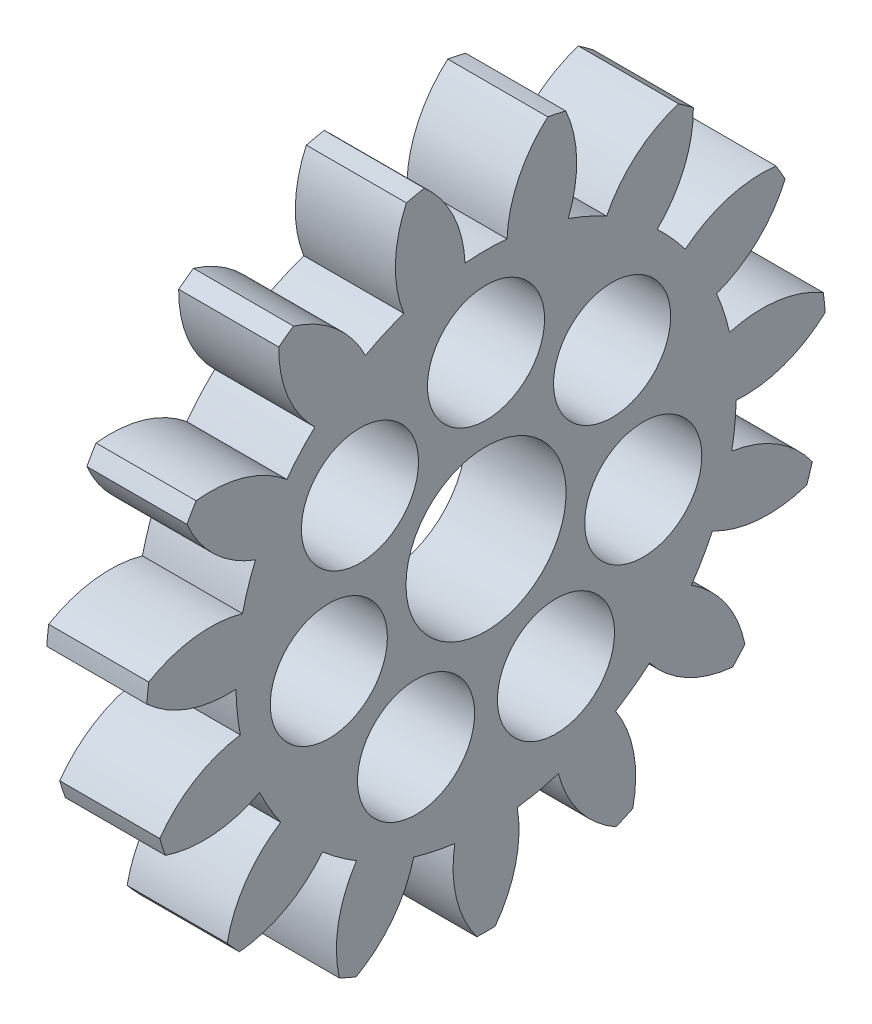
ISO-10303-21;
HEADER;
FILE_DESCRIPTION(('STEP AP214'),'2;1');
FILE_NAME('part.step','',(''),(''),'','','');
FILE_SCHEMA(('AUTOMOTIVE_DESIGN { 1 0 10303 214 1 1 1 1 }'));
ENDSEC;
DATA;
#1=APPLICATION_CONTEXT('core data for automotive mechanical design processes');
#2=APPLICATION_PROTOCOL_DEFINITION('international standard','automotive_design',2000,#1);
#3=PRODUCT_CONTEXT('',#1,'mechanical');
#4=PRODUCT('Part','Part','',(#3));
#5=PRODUCT_RELATED_PRODUCT_CATEGORY('part','',(#4));
#6=PRODUCT_DEFINITION_FORMATION('','',#4);
#7=PRODUCT_DEFINITION_CONTEXT('part definition',#1,'design');
#8=PRODUCT_DEFINITION('design','',#6,#7);
#9=PRODUCT_DEFINITION_SHAPE('','',#8);
#10=(LENGTH_UNIT() NAMED_UNIT(*) SI_UNIT(.MILLI.,.METRE.));
#11=(NAMED_UNIT(*) PLANE_ANGLE_UNIT() SI_UNIT($,.RADIAN.));
#12=(NAMED_UNIT(*) SI_UNIT($,.STERADIAN.) SOLID_ANGLE_UNIT());
#13=UNCERTAINTY_MEASURE_WITH_UNIT(LENGTH_MEASURE(1.E-05),#10,'distance_accuracy_value','');
#14=(GEOMETRIC_REPRESENTATION_CONTEXT(3) GLOBAL_UNCERTAINTY_ASSIGNED_CONTEXT((#13)) GLOBAL_UNIT_ASSIGNED_CONTEXT((#10,
#11,#12)) REPRESENTATION_CONTEXT('',''));
#15=CARTESIAN_POINT('',(0.,0.,0.));
#16=DIRECTION('',(0.,0.,1.));
#17=DIRECTION('',(1.,0.,0.));
#18=AXIS2_PLACEMENT_3D('',#15,#16,#17);
#19=CARTESIAN_POINT('',(5.,0.,0.));
#20=DIRECTION('',(-1.,0.,0.));
#21=DIRECTION('',(0.,0.,1.));
#22=AXIS2_PLACEMENT_3D('',#19,#20,#21);
#23=PLANE('',#22);
#24=CARTESIAN_POINT('',(5.,-7.25889177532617,3.4956980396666));
#25=DIRECTION('',(1.,0.,0.));
#26=DIRECTION('',(0.,0.,-1.));
#27=AXIS2_PLACEMENT_3D('',#24,#25,#26);
#28=CIRCLE('',#27,2.92569446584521);
#29=CARTESIAN_POINT('',(5.,-7.25889177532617,0.570003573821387));
#30=VERTEX_POINT('',#29);
#31=EDGE_CURVE('E830',#30,#30,#28,.T.);
#32=ORIENTED_EDGE('',*,*,#31,.F.);
#33=EDGE_LOOP('',(#32));
#34=FACE_BOUND('',#33,.T.);
#35=CARTESIAN_POINT('',(5.,-7.25889177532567,-3.49569803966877));
#36=DIRECTION('',(1.,0.,0.));
#37=DIRECTION('',(0.,0.,-1.));
#38=AXIS2_PLACEMENT_3D('',#35,#36,#37);
#39=CIRCLE('',#38,2.92569446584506);
#40=CARTESIAN_POINT('',(5.,-7.25889177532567,-6.42139250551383));
#41=VERTEX_POINT('',#40);
#42=EDGE_CURVE('E834',#41,#41,#39,.T.);
#43=ORIENTED_EDGE('',*,*,#42,.F.);
#44=EDGE_LOOP('',(#43));
#45=FACE_BOUND('',#44,.T.);
#46=CARTESIAN_POINT('',(5.,-1.79279821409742,-7.85476219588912));
#47=DIRECTION('',(1.,0.,0.));
#48=DIRECTION('',(0.,0.,-1.));
#49=AXIS2_PLACEMENT_3D('',#46,#47,#48);
#50=CIRCLE('',#49,2.92569446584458);
#51=CARTESIAN_POINT('',(5.,-1.79279821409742,-10.7804566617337));
#52=VERTEX_POINT('',#51);
#53=EDGE_CURVE('E838',#52,#52,#50,.T.);
#54=ORIENTED_EDGE('',*,*,#53,.F.);
#55=EDGE_LOOP('',(#54));
#56=FACE_BOUND('',#55,.T.);
#57=CARTESIAN_POINT('',(5.,5.02330896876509,-6.29903021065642));
#58=DIRECTION('',(1.,0.,0.));
#59=DIRECTION('',(0.,0.,-1.));
#60=AXIS2_PLACEMENT_3D('',#57,#58,#59);
#61=CIRCLE('',#60,2.92569446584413);
#62=CARTESIAN_POINT('',(5.,5.02330896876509,-9.22472467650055));
#63=VERTEX_POINT('',#62);
#64=EDGE_CURVE('E842',#63,#63,#61,.T.);
#65=ORIENTED_EDGE('',*,*,#64,.F.);
#66=EDGE_LOOP('',(#65));
#67=FACE_BOUND('',#66,.T.);
#68=CARTESIAN_POINT('',(5.,-1.79279821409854,7.85476219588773));
#69=DIRECTION('',(1.,0.,0.));
#70=DIRECTION('',(0.,0.,-1.));
#71=AXIS2_PLACEMENT_3D('',#68,#69,#70);
#72=CIRCLE('',#71,2.92569446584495);
#73=CARTESIAN_POINT('',(5.,-1.79279821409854,4.92906773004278));
#74=VERTEX_POINT('',#73);
#75=EDGE_CURVE('E846',#74,#74,#72,.T.);
#76=ORIENTED_EDGE('',*,*,#75,.F.);
#77=EDGE_LOOP('',(#76));
#78=FACE_BOUND('',#77,.T.);
#79=CARTESIAN_POINT('',(5.,5.0233089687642,6.29903021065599));
#80=DIRECTION('',(1.,0.,0.));
#81=DIRECTION('',(0.,0.,-1.));
#82=AXIS2_PLACEMENT_3D('',#79,#80,#81);
#83=CIRCLE('',#82,2.92569446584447);
#84=CARTESIAN_POINT('',(5.,5.0233089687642,3.37333574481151));
#85=VERTEX_POINT('',#84);
#86=EDGE_CURVE('E850',#85,#85,#83,.T.);
#87=ORIENTED_EDGE('',*,*,#86,.F.);
#88=EDGE_LOOP('',(#87));
#89=FACE_BOUND('',#88,.T.);
#90=CARTESIAN_POINT('',(5.,8.05676204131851,0.));
#91=DIRECTION('',(1.,0.,0.));
#92=DIRECTION('',(0.,0.,-1.));
#93=AXIS2_PLACEMENT_3D('',#90,#91,#92);
#94=CIRCLE('',#93,2.92569446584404);
#95=CARTESIAN_POINT('',(5.,8.05676204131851,-2.92569446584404));
#96=VERTEX_POINT('',#95);
#97=EDGE_CURVE('E786',#96,#96,#94,.T.);
#98=ORIENTED_EDGE('',*,*,#97,.F.);
#99=EDGE_LOOP('',(#98));
#100=FACE_BOUND('',#99,.T.);
#101=CARTESIAN_POINT('',(5.,0.,0.));
#102=DIRECTION('',(-1.,0.,0.));
#103=DIRECTION('',(0.,0.,1.));
#104=AXIS2_PLACEMENT_3D('',#101,#102,#103);
#105=CIRCLE('',#104,4.);
#106=CARTESIAN_POINT('',(5.,0.,4.));
#107=VERTEX_POINT('',#106);
#108=EDGE_CURVE('E587',#107,#107,#105,.F.);
#109=ORIENTED_EDGE('',*,*,#108,.F.);
#110=EDGE_LOOP('',(#109));
#111=FACE_BOUND('',#110,.T.);
#112=CARTESIAN_POINT('',(5.,5.73026813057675,12.8780443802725));
#113=DIRECTION('',(-1.,0.,0.));
#114=DIRECTION('',(0.,0.994521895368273,0.104528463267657));
#115=AXIS2_PLACEMENT_3D('',#112,#113,#114);
#116=CIRCLE('',#115,6.);
#117=CARTESIAN_POINT('',(5.,-0.257578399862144,12.4963456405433));
#118=VERTEX_POINT('',#117);
#119=CARTESIAN_POINT('',(5.,1.32216889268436,16.9485064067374));
#120=VERTEX_POINT('',#119);
#121=EDGE_CURVE('E443',#118,#120,#116,.T.);
#122=ORIENTED_EDGE('',*,*,#121,.F.);
#123=CARTESIAN_POINT('',(5.,0.,0.));
#124=DIRECTION('',(-1.,0.,0.));
#125=DIRECTION('',(0.,0.994521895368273,0.104528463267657));
#126=AXIS2_PLACEMENT_3D('',#123,#124,#125);
#127=CIRCLE('',#126,12.499);
#128=CARTESIAN_POINT('',(5.,-2.34618665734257,12.2768240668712));
#129=VERTEX_POINT('',#128);
#130=EDGE_CURVE('E448',#129,#118,#127,.T.);
#131=ORIENTED_EDGE('',*,*,#130,.F.);
#132=CARTESIAN_POINT('',(5.,-8.28254400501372,11.4052384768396));
#133=DIRECTION('',(-1.,0.,0.));
#134=DIRECTION('',(0.,0.994521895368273,0.104528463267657));
#135=AXIS2_PLACEMENT_3D('',#132,#133,#134);
#136=CIRCLE('',#135,6.);
#137=CARTESIAN_POINT('',(5.,-4.81706895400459,16.303246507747));
#138=VERTEX_POINT('',#137);
#139=EDGE_CURVE('E445',#138,#129,#136,.T.);
#140=ORIENTED_EDGE('',*,*,#139,.F.);
#141=CARTESIAN_POINT('',(5.,0.,0.));
#142=DIRECTION('',(-1.,0.,0.));
#143=DIRECTION('',(0.,0.,1.));
#144=AXIS2_PLACEMENT_3D('',#141,#142,#143);
#145=CIRCLE('',#144,17.);
#146=CARTESIAN_POINT('',(5.,-5.68571721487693,16.0210055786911));
#147=VERTEX_POINT('',#146);
#148=EDGE_CURVE('E873',#147,#138,#145,.T.);
#149=ORIENTED_EDGE('',*,*,#148,.F.);
#150=CARTESIAN_POINT('',(5.,-0.00311211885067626,14.0953889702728));
#151=DIRECTION('',(-1.,0.,0.));
#152=DIRECTION('',(0.,0.866025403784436,0.500000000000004));
#153=AXIS2_PLACEMENT_3D('',#150,#151,#152);
#154=CIRCLE('',#153,6.);
#155=CARTESIAN_POINT('',(5.,-5.3180312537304,11.3112132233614));
#156=VERTEX_POINT('',#155);
#157=EDGE_CURVE('E510',#156,#147,#154,.T.);
#158=ORIENTED_EDGE('',*,*,#157,.F.);
#159=CARTESIAN_POINT('',(5.,0.,0.));
#160=DIRECTION('',(-1.,0.,0.));
#161=DIRECTION('',(0.,0.866025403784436,0.500000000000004));
#162=AXIS2_PLACEMENT_3D('',#159,#160,#161);
#163=CIRCLE('',#162,12.499);
#164=CARTESIAN_POINT('',(5.,-7.13678237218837,10.2611567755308));
#165=VERTEX_POINT('',#164);
#166=EDGE_CURVE('E515',#165,#156,#163,.T.);
#167=ORIENTED_EDGE('',*,*,#166,.F.);
#168=CARTESIAN_POINT('',(5.,-12.205408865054,7.05038965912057));
#169=DIRECTION('',(-1.,0.,0.));
#170=DIRECTION('',(0.,0.866025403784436,0.500000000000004));
#171=AXIS2_PLACEMENT_3D('',#168,#169,#170);
#172=CIRCLE('',#171,6.);
#173=CARTESIAN_POINT('',(5.,-11.0317392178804,12.9344783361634));
#174=VERTEX_POINT('',#173);
#175=EDGE_CURVE('E512',#174,#165,#172,.T.);
#176=ORIENTED_EDGE('',*,*,#175,.F.);
#177=CARTESIAN_POINT('',(5.,-11.7104911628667,12.3233273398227));
#178=VERTEX_POINT('',#177);
#179=EDGE_CURVE('E925',#178,#174,#145,.T.);
#180=ORIENTED_EDGE('',*,*,#179,.F.);
#181=CARTESIAN_POINT('',(5.,-5.73595425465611,12.8755127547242));
#182=DIRECTION('',(-1.,0.,0.));
#183=DIRECTION('',(0.,0.587785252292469,0.80901699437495));
#184=AXIS2_PLACEMENT_3D('',#181,#182,#183);
#185=CIRCLE('',#184,6.);
#186=CARTESIAN_POINT('',(5.,-9.45894819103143,8.17026928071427));
#187=VERTEX_POINT('',#186);
#188=EDGE_CURVE('E493',#187,#178,#185,.T.);
#189=ORIENTED_EDGE('',*,*,#188,.F.);
#190=CARTESIAN_POINT('',(5.,0.,0.));
#191=DIRECTION('',(-1.,0.,0.));
#192=DIRECTION('',(0.,0.587785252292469,0.80901699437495));
#193=AXIS2_PLACEMENT_3D('',#190,#191,#192);
#194=CIRCLE('',#193,12.499);
#195=CARTESIAN_POINT('',(5.,-10.6933635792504,6.4712422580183));
#196=VERTEX_POINT('',#195);
#197=EDGE_CURVE('E498',#196,#187,#194,.T.);
#198=ORIENTED_EDGE('',*,*,#197,.F.);
#199=CARTESIAN_POINT('',(5.,-14.0178476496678,1.4764644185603));
#200=DIRECTION('',(-1.,0.,0.));
#201=DIRECTION('',(0.,0.587785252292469,0.80901699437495));
#202=AXIS2_PLACEMENT_3D('',#199,#200,#201);
#203=CIRCLE('',#202,6.);
#204=CARTESIAN_POINT('',(5.,-15.3389215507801,7.32922135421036));
#205=VERTEX_POINT('',#204);
#206=EDGE_CURVE('E495',#205,#196,#203,.T.);
#207=ORIENTED_EDGE('',*,*,#206,.F.);
#208=CARTESIAN_POINT('',(5.,-15.7104148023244,6.49483384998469));
#209=VERTEX_POINT('',#208);
#210=EDGE_CURVE('E919',#209,#205,#145,.T.);
#211=ORIENTED_EDGE('',*,*,#210,.F.);
#212=CARTESIAN_POINT('',(5.,-10.476997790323,9.42934341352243));
#213=DIRECTION('',(-1.,0.,0.));
#214=DIRECTION('',(0.,0.207911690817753,0.978147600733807));
#215=AXIS2_PLACEMENT_3D('',#212,#213,#214);
#216=CIRCLE('',#215,6.);
#217=CARTESIAN_POINT('',(5.,-11.9643270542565,3.61661155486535));
#218=VERTEX_POINT('',#217);
#219=EDGE_CURVE('E474',#218,#209,#216,.T.);
#220=ORIENTED_EDGE('',*,*,#219,.F.);
#221=CARTESIAN_POINT('',(5.,0.,0.));
#222=DIRECTION('',(-1.,0.,0.));
#223=DIRECTION('',(0.,0.207911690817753,0.978147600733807));
#224=AXIS2_PLACEMENT_3D('',#221,#222,#223);
#225=CIRCLE('',#224,12.499);
#226=CARTESIAN_POINT('',(5.,-12.4009650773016,1.56239116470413));
#227=VERTEX_POINT('',#226);
#228=EDGE_CURVE('E479',#227,#218,#225,.T.);
#229=ORIENTED_EDGE('',*,*,#228,.F.);
#230=CARTESIAN_POINT('',(5.,-13.4064732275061,-4.35275493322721));
#231=DIRECTION('',(-1.,0.,0.));
#232=DIRECTION('',(0.,0.207911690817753,0.978147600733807));
#233=AXIS2_PLACEMENT_3D('',#230,#231,#232);
#234=CIRCLE('',#233,6.);
#235=CARTESIAN_POINT('',(5.,-16.9938649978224,0.456675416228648));
#236=VERTEX_POINT('',#235);
#237=EDGE_CURVE('E476',#236,#227,#234,.T.);
#238=ORIENTED_EDGE('',*,*,#237,.F.);
#239=CARTESIAN_POINT('',(5.,-16.9938649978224,-0.456675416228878));
#240=VERTEX_POINT('',#239);
#241=EDGE_CURVE('E913',#240,#236,#145,.T.);
#242=ORIENTED_EDGE('',*,*,#241,.F.);
#243=CARTESIAN_POINT('',(5.,-13.4064732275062,4.35275493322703));
#244=DIRECTION('',(-1.,0.,0.));
#245=DIRECTION('',(0.,-0.207911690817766,0.978147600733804));
#246=AXIS2_PLACEMENT_3D('',#243,#244,#245);
#247=CIRCLE('',#246,6.);
#248=CARTESIAN_POINT('',(5.,-12.4009650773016,-1.5623911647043));
#249=VERTEX_POINT('',#248);
#250=EDGE_CURVE('E561',#249,#240,#247,.T.);
#251=ORIENTED_EDGE('',*,*,#250,.F.);
#252=CARTESIAN_POINT('',(5.,0.,0.));
#253=DIRECTION('',(-1.,0.,0.));
#254=DIRECTION('',(0.,-0.207911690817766,0.978147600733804));
#255=AXIS2_PLACEMENT_3D('',#252,#253,#254);
#256=CIRCLE('',#255,12.499);
#257=CARTESIAN_POINT('',(5.,-11.9643270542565,-3.61661155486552));
#258=VERTEX_POINT('',#257);
#259=EDGE_CURVE('E566',#258,#249,#256,.T.);
#260=ORIENTED_EDGE('',*,*,#259,.F.);
#261=CARTESIAN_POINT('',(5.,-10.4769977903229,-9.42934341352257));
#262=DIRECTION('',(-1.,0.,0.));
#263=DIRECTION('',(0.,-0.207911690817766,0.978147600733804));
#264=AXIS2_PLACEMENT_3D('',#261,#262,#263);
#265=CIRCLE('',#264,6.);
#266=CARTESIAN_POINT('',(5.,-15.7104148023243,-6.4948338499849));
#267=VERTEX_POINT('',#266);
#268=EDGE_CURVE('E563',#267,#258,#265,.T.);
#269=ORIENTED_EDGE('',*,*,#268,.F.);
#270=CARTESIAN_POINT('',(5.,-15.33892155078,-7.32922135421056));
#271=VERTEX_POINT('',#270);
#272=EDGE_CURVE('E907',#271,#267,#145,.T.);
#273=ORIENTED_EDGE('',*,*,#272,.F.);
#274=CARTESIAN_POINT('',(5.,-14.0178476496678,-1.47646441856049));
#275=DIRECTION('',(-1.,0.,0.));
#276=DIRECTION('',(0.,-0.58778525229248,0.809016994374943));
#277=AXIS2_PLACEMENT_3D('',#274,#275,#276);
#278=CIRCLE('',#277,6.);
#279=CARTESIAN_POINT('',(5.,-10.6933635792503,-6.47124225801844));
#280=VERTEX_POINT('',#279);
#281=EDGE_CURVE('E544',#280,#271,#278,.T.);
#282=ORIENTED_EDGE('',*,*,#281,.F.);
#283=CARTESIAN_POINT('',(5.,0.,0.));
#284=DIRECTION('',(-1.,0.,0.));
#285=DIRECTION('',(0.,-0.58778525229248,0.809016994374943));
#286=AXIS2_PLACEMENT_3D('',#283,#284,#285);
#287=CIRCLE('',#286,12.499);
#288=CARTESIAN_POINT('',(5.,-9.45894819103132,-8.1702692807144));
#289=VERTEX_POINT('',#288);
#290=EDGE_CURVE('E549',#289,#280,#287,.T.);
#291=ORIENTED_EDGE('',*,*,#290,.F.);
#292=CARTESIAN_POINT('',(5.,-5.73595425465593,-12.8755127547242));
#293=DIRECTION('',(-1.,0.,0.));
#294=DIRECTION('',(0.,-0.58778525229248,0.809016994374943));
#295=AXIS2_PLACEMENT_3D('',#292,#293,#294);
#296=CIRCLE('',#295,6.);
#297=CARTESIAN_POINT('',(5.,-11.7104911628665,-12.3233273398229));
#298=VERTEX_POINT('',#297);
#299=EDGE_CURVE('E546',#298,#289,#296,.T.);
#300=ORIENTED_EDGE('',*,*,#299,.F.);
#301=CARTESIAN_POINT('',(5.,-11.0317392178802,-12.9344783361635));
#302=VERTEX_POINT('',#301);
#303=EDGE_CURVE('E901',#302,#298,#145,.T.);
#304=ORIENTED_EDGE('',*,*,#303,.F.);
#305=CARTESIAN_POINT('',(5.,-12.2054088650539,-7.05038965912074));
#306=DIRECTION('',(-1.,0.,0.));
#307=DIRECTION('',(0.,-0.866025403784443,0.499999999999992));
#308=AXIS2_PLACEMENT_3D('',#305,#306,#307);
#309=CIRCLE('',#308,6.);
#310=CARTESIAN_POINT('',(5.,-7.13678237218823,-10.2611567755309));
#311=VERTEX_POINT('',#310);
#312=EDGE_CURVE('E525',#311,#302,#309,.T.);
#313=ORIENTED_EDGE('',*,*,#312,.F.);
#314=CARTESIAN_POINT('',(5.,0.,0.));
#315=DIRECTION('',(-1.,0.,0.));
#316=DIRECTION('',(0.,-0.866025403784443,0.499999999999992));
#317=AXIS2_PLACEMENT_3D('',#314,#315,#316);
#318=CIRCLE('',#317,12.499);
#319=CARTESIAN_POINT('',(5.,-5.31803125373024,-11.3112132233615));
#320=VERTEX_POINT('',#319);
#321=EDGE_CURVE('E530',#320,#311,#318,.T.);
#322=ORIENTED_EDGE('',*,*,#321,.F.);
#323=CARTESIAN_POINT('',(5.,-0.00311211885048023,-14.0953889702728));
#324=DIRECTION('',(-1.,0.,0.));
#325=DIRECTION('',(0.,-0.866025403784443,0.499999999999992));
#326=AXIS2_PLACEMENT_3D('',#323,#324,#325);
#327=CIRCLE('',#326,6.);
#328=CARTESIAN_POINT('',(5.,-5.6857172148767,-16.0210055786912));
#329=VERTEX_POINT('',#328);
#330=EDGE_CURVE('E527',#329,#320,#327,.T.);
#331=ORIENTED_EDGE('',*,*,#330,.F.);
#332=CARTESIAN_POINT('',(5.,-4.81706895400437,-16.3032465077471));
#333=VERTEX_POINT('',#332);
#334=EDGE_CURVE('E895',#333,#329,#145,.T.);
#335=ORIENTED_EDGE('',*,*,#334,.F.);
#336=CARTESIAN_POINT('',(5.,-8.28254400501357,-11.4052384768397));
#337=DIRECTION('',(-1.,0.,0.));
#338=DIRECTION('',(0.,-0.994521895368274,0.104528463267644));
#339=AXIS2_PLACEMENT_3D('',#336,#337,#338);
#340=CIRCLE('',#339,6.);
#341=CARTESIAN_POINT('',(5.,-2.3461866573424,-12.2768240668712));
#342=VERTEX_POINT('',#341);
#343=EDGE_CURVE('E612',#342,#333,#340,.T.);
#344=ORIENTED_EDGE('',*,*,#343,.F.);
#345=CARTESIAN_POINT('',(5.,0.,0.));
#346=DIRECTION('',(-1.,0.,0.));
#347=DIRECTION('',(0.,-0.994521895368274,0.104528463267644));
#348=AXIS2_PLACEMENT_3D('',#345,#346,#347);
#349=CIRCLE('',#348,12.499);
#350=CARTESIAN_POINT('',(5.,-0.257578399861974,-12.4963456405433));
#351=VERTEX_POINT('',#350);
#352=EDGE_CURVE('E617',#351,#342,#349,.T.);
#353=ORIENTED_EDGE('',*,*,#352,.F.);
#354=CARTESIAN_POINT('',(5.,5.73026813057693,-12.8780443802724));
#355=DIRECTION('',(-1.,0.,0.));
#356=DIRECTION('',(0.,-0.994521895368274,0.104528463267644));
#357=AXIS2_PLACEMENT_3D('',#354,#355,#356);
#358=CIRCLE('',#357,6.);
#359=CARTESIAN_POINT('',(5.,1.32216889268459,-16.9485064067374));
#360=VERTEX_POINT('',#359);
#361=EDGE_CURVE('E614',#360,#351,#358,.T.);
#362=ORIENTED_EDGE('',*,*,#361,.F.);
#363=CARTESIAN_POINT('',(5.,2.23051629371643,-16.8530352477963));
#364=VERTEX_POINT('',#363);
#365=EDGE_CURVE('E889',#364,#360,#145,.T.);
#366=ORIENTED_EDGE('',*,*,#365,.F.);
#367=CARTESIAN_POINT('',(5.,-2.92755204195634,-13.7880179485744));
#368=DIRECTION('',(-1.,0.,0.));
#369=DIRECTION('',(0.,-0.95105651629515,-0.309016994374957));
#370=AXIS2_PLACEMENT_3D('',#367,#368,#369);
#371=CIRCLE('',#370,6.);
#372=CARTESIAN_POINT('',(5.,2.85008604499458,-12.1697169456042));
#373=VERTEX_POINT('',#372);
#374=EDGE_CURVE('E629',#373,#364,#371,.T.);
#375=ORIENTED_EDGE('',*,*,#374,.F.);
#376=CARTESIAN_POINT('',(5.,0.,0.));
#377=DIRECTION('',(-1.,0.,0.));
#378=DIRECTION('',(0.,-0.95105651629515,-0.309016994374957));
#379=AXIS2_PLACEMENT_3D('',#376,#377,#378);
#380=CIRCLE('',#379,12.499);
#381=CARTESIAN_POINT('',(5.,4.84741209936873,-11.5207463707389));
#382=VERTEX_POINT('',#381);
#383=EDGE_CURVE('E634',#382,#373,#380,.T.);
#384=ORIENTED_EDGE('',*,*,#383,.F.);
#385=CARTESIAN_POINT('',(5.,10.4728329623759,-9.43396892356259));
#386=DIRECTION('',(-1.,0.,0.));
#387=DIRECTION('',(0.,-0.95105651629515,-0.309016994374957));
#388=AXIS2_PLACEMENT_3D('',#385,#386,#387);
#389=CIRCLE('',#388,6.);
#390=CARTESIAN_POINT('',(5.,8.10143998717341,-14.9454565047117));
#391=VERTEX_POINT('',#390);
#392=EDGE_CURVE('E631',#391,#382,#389,.T.);
#393=ORIENTED_EDGE('',*,*,#392,.F.);
#394=CARTESIAN_POINT('',(5.,8.89242501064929,-14.4887810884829));
#395=VERTEX_POINT('',#394);
#396=EDGE_CURVE('E883',#395,#391,#145,.T.);
#397=ORIENTED_EDGE('',*,*,#396,.F.);
#398=CARTESIAN_POINT('',(5.,2.9336402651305,-13.7867238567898));
#399=DIRECTION('',(-1.,0.,0.));
#400=DIRECTION('',(0.,-0.743144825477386,-0.669130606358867));
#401=AXIS2_PLACEMENT_3D('',#398,#399,#400);
#402=CIRCLE('',#401,6.);
#403=CARTESIAN_POINT('',(5.,7.55355297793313,-9.95835520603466));
#404=VERTEX_POINT('',#403);
#405=EDGE_CURVE('E595',#404,#395,#402,.T.);
#406=ORIENTED_EDGE('',*,*,#405,.F.);
#407=CARTESIAN_POINT('',(5.,0.,0.));
#408=DIRECTION('',(-1.,0.,0.));
#409=DIRECTION('',(0.,-0.743144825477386,-0.669130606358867));
#410=AXIS2_PLACEMENT_3D('',#407,#408,#409);
#411=CIRCLE('',#410,12.499);
#412=CARTESIAN_POINT('',(5.,9.11424100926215,-8.55310539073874));
#413=VERTEX_POINT('',#412);
#414=EDGE_CURVE('E600',#413,#404,#411,.T.);
#415=ORIENTED_EDGE('',*,*,#414,.F.);
#416=CARTESIAN_POINT('',(5.,13.4045498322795,-4.35867453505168));
#417=DIRECTION('',(-1.,0.,0.));
#418=DIRECTION('',(0.,-0.743144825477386,-0.669130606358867));
#419=AXIS2_PLACEMENT_3D('',#416,#417,#418);
#420=CIRCLE('',#419,6.);
#421=CARTESIAN_POINT('',(5.,13.4798985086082,-10.3582013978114));
#422=VERTEX_POINT('',#421);
#423=EDGE_CURVE('E597',#422,#413,#420,.T.);
#424=ORIENTED_EDGE('',*,*,#423,.F.);
#425=CARTESIAN_POINT('',(5.,14.0167526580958,-9.61928505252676));
#426=VERTEX_POINT('',#425);
#427=EDGE_CURVE('E749',#426,#422,#145,.T.);
#428=ORIENTED_EDGE('',*,*,#427,.F.);
#429=CARTESIAN_POINT('',(5.,8.28757951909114,-11.401579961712));
#430=DIRECTION('',(-1.,0.,0.));
#431=DIRECTION('',(0.,-0.406736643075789,-0.913545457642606));
#432=AXIS2_PLACEMENT_3D('',#429,#430,#431);
#433=CIRCLE('',#432,6.);
#434=CARTESIAN_POINT('',(5.,10.9509419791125,-6.02510338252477));
#435=VERTEX_POINT('',#434);
#436=EDGE_CURVE('E576',#435,#426,#433,.T.);
#437=ORIENTED_EDGE('',*,*,#436,.F.);
#438=CARTESIAN_POINT('',(5.,0.,0.));
#439=DIRECTION('',(-1.,0.,0.));
#440=DIRECTION('',(0.,-0.406736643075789,-0.913545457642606));
#441=AXIS2_PLACEMENT_3D('',#438,#439,#440);
#442=CIRCLE('',#441,12.499);
#443=CARTESIAN_POINT('',(5.,11.805134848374,-4.10655478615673));
#444=VERTEX_POINT('',#443);
#445=EDGE_CURVE('E581',#444,#435,#442,.T.);
#446=ORIENTED_EDGE('',*,*,#445,.F.);
#447=CARTESIAN_POINT('',(5.,14.0184982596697,1.4702742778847));
#448=DIRECTION('',(-1.,0.,0.));
#449=DIRECTION('',(0.,-0.406736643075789,-0.913545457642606));
#450=AXIS2_PLACEMENT_3D('',#447,#448,#449);
#451=CIRCLE('',#450,6.);
#452=CARTESIAN_POINT('',(5.,16.5275601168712,-3.97991916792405));
#453=VERTEX_POINT('',#452);
#454=EDGE_CURVE('E578',#453,#444,#451,.T.);
#455=ORIENTED_EDGE('',*,*,#454,.F.);
#456=CARTESIAN_POINT('',(5.,16.7174564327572,-3.08652724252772));
#457=VERTEX_POINT('',#456);
#458=EDGE_CURVE('E745',#457,#453,#145,.T.);
#459=ORIENTED_EDGE('',*,*,#458,.F.);
#460=CARTESIAN_POINT('',(5.,12.2085209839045,-7.04499931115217));
#461=DIRECTION('',(-1.,0.,0.));
#462=DIRECTION('',(0.,0.,-1.));
#463=AXIS2_PLACEMENT_3D('',#460,#461,#462);
#464=CIRCLE('',#463,6.);
#465=CARTESIAN_POINT('',(5.,12.4548136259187,-1.05005644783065));
#466=VERTEX_POINT('',#465);
#467=EDGE_CURVE('E717',#466,#457,#464,.T.);
#468=ORIENTED_EDGE('',*,*,#467,.F.);
#469=CARTESIAN_POINT('',(5.,0.,0.));
#470=DIRECTION('',(-1.,0.,0.));
#471=DIRECTION('',(0.,0.,-1.));
#472=AXIS2_PLACEMENT_3D('',#469,#470,#471);
#473=CIRCLE('',#472,12.499);
#474=CARTESIAN_POINT('',(5.,12.4548136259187,1.05005644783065));
#475=VERTEX_POINT('',#474);
#476=EDGE_CURVE('E722',#475,#466,#473,.T.);
#477=ORIENTED_EDGE('',*,*,#476,.F.);
#478=CARTESIAN_POINT('',(5.,12.2085209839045,7.04499931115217));
#479=DIRECTION('',(-1.,0.,0.));
#480=DIRECTION('',(0.,0.,-1.));
#481=AXIS2_PLACEMENT_3D('',#478,#479,#480);
#482=CIRCLE('',#481,6.);
#483=CARTESIAN_POINT('',(5.,16.7174564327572,3.08652724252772));
#484=VERTEX_POINT('',#483);
#485=EDGE_CURVE('E719',#484,#475,#482,.T.);
#486=ORIENTED_EDGE('',*,*,#485,.F.);
#487=CARTESIAN_POINT('',(5.,16.5275601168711,3.97991916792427));
#488=VERTEX_POINT('',#487);
#489=EDGE_CURVE('E742',#488,#484,#145,.T.);
#490=ORIENTED_EDGE('',*,*,#489,.F.);
#491=CARTESIAN_POINT('',(5.,14.0184982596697,-1.47027427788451));
#492=DIRECTION('',(-1.,0.,0.));
#493=DIRECTION('',(0.,0.406736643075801,-0.913545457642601));
#494=AXIS2_PLACEMENT_3D('',#491,#492,#493);
#495=CIRCLE('',#494,6.);
#496=CARTESIAN_POINT('',(5.,11.8051348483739,4.10655478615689));
#497=VERTEX_POINT('',#496);
#498=EDGE_CURVE('E695',#497,#488,#495,.T.);
#499=ORIENTED_EDGE('',*,*,#498,.F.);
#500=CARTESIAN_POINT('',(5.,0.,0.));
#501=DIRECTION('',(-1.,0.,0.));
#502=DIRECTION('',(0.,0.406736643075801,-0.913545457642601));
#503=AXIS2_PLACEMENT_3D('',#500,#501,#502);
#504=CIRCLE('',#503,12.499);
#505=CARTESIAN_POINT('',(5.,10.9509419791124,6.02510338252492));
#506=VERTEX_POINT('',#505);
#507=EDGE_CURVE('E700',#506,#497,#504,.T.);
#508=ORIENTED_EDGE('',*,*,#507,.F.);
#509=CARTESIAN_POINT('',(5.,8.28757951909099,11.4015799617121));
#510=DIRECTION('',(-1.,0.,0.));
#511=DIRECTION('',(0.,0.406736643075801,-0.913545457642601));
#512=AXIS2_PLACEMENT_3D('',#509,#510,#511);
#513=CIRCLE('',#512,6.);
#514=CARTESIAN_POINT('',(5.,14.0167526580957,9.61928505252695));
#515=VERTEX_POINT('',#514);
#516=EDGE_CURVE('E697',#515,#506,#513,.T.);
#517=ORIENTED_EDGE('',*,*,#516,.F.);
#518=CARTESIAN_POINT('',(5.,13.4798985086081,10.3582013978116));
#519=VERTEX_POINT('',#518);
#520=EDGE_CURVE('E750',#519,#515,#145,.T.);
#521=ORIENTED_EDGE('',*,*,#520,.F.);
#522=CARTESIAN_POINT('',(5.,13.4045498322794,4.35867453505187));
#523=DIRECTION('',(-1.,0.,0.));
#524=DIRECTION('',(0.,0.743144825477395,-0.669130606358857));
#525=AXIS2_PLACEMENT_3D('',#522,#523,#524);
#526=CIRCLE('',#525,6.);
#527=CARTESIAN_POINT('',(5.,9.11424100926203,8.55310539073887));
#528=VERTEX_POINT('',#527);
#529=EDGE_CURVE('E457',#528,#519,#526,.T.);
#530=ORIENTED_EDGE('',*,*,#529,.F.);
#531=CARTESIAN_POINT('',(5.,0.,0.));
#532=DIRECTION('',(-1.,0.,0.));
#533=DIRECTION('',(0.,0.743144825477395,-0.669130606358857));
#534=AXIS2_PLACEMENT_3D('',#531,#532,#533);
#535=CIRCLE('',#534,12.499);
#536=CARTESIAN_POINT('',(5.,7.55355297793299,9.95835520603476));
#537=VERTEX_POINT('',#536);
#538=EDGE_CURVE('E462',#537,#528,#535,.T.);
#539=ORIENTED_EDGE('',*,*,#538,.F.);
#540=CARTESIAN_POINT('',(5.,2.93364026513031,13.7867238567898));
#541=DIRECTION('',(-1.,0.,0.));
#542=DIRECTION('',(0.,0.743144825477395,-0.669130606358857));
#543=AXIS2_PLACEMENT_3D('',#540,#541,#542);
#544=CIRCLE('',#543,6.);
#545=CARTESIAN_POINT('',(5.,8.89242501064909,14.488781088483));
#546=VERTEX_POINT('',#545);
#547=EDGE_CURVE('E459',#546,#537,#544,.T.);
#548=ORIENTED_EDGE('',*,*,#547,.F.);
#549=CARTESIAN_POINT('',(5.,8.10143998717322,14.9454565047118));
#550=VERTEX_POINT('',#549);
#551=EDGE_CURVE('E867',#550,#546,#145,.T.);
#552=ORIENTED_EDGE('',*,*,#551,.F.);
#553=CARTESIAN_POINT('',(5.,10.4728329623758,9.43396892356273));
#554=DIRECTION('',(-1.,0.,0.));
#555=DIRECTION('',(0.,0.951056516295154,-0.309016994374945));
#556=AXIS2_PLACEMENT_3D('',#553,#554,#555);
#557=CIRCLE('',#556,6.);
#558=CARTESIAN_POINT('',(5.,4.84741209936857,11.520746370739));
#559=VERTEX_POINT('',#558);
#560=EDGE_CURVE('E423',#559,#550,#557,.T.);
#561=ORIENTED_EDGE('',*,*,#560,.F.);
#562=CARTESIAN_POINT('',(5.,0.,0.));
#563=DIRECTION('',(-1.,0.,0.));
#564=DIRECTION('',(0.,0.951056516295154,-0.309016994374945));
#565=AXIS2_PLACEMENT_3D('',#562,#563,#564);
#566=CIRCLE('',#565,12.499);
#567=CARTESIAN_POINT('',(5.,2.85008604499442,12.1697169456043));
#568=VERTEX_POINT('',#567);
#569=EDGE_CURVE('E422',#568,#559,#566,.T.);
#570=ORIENTED_EDGE('',*,*,#569,.F.);
#571=CARTESIAN_POINT('',(5.,-2.92755204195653,13.7880179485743));
#572=DIRECTION('',(-1.,0.,0.));
#573=DIRECTION('',(0.,0.951056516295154,-0.309016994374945));
#574=AXIS2_PLACEMENT_3D('',#571,#572,#573);
#575=CIRCLE('',#574,6.);
#576=CARTESIAN_POINT('',(5.,2.23051629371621,16.8530352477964));
#577=VERTEX_POINT('',#576);
#578=EDGE_CURVE('E411',#577,#568,#575,.T.);
#579=ORIENTED_EDGE('',*,*,#578,.F.);
#580=EDGE_CURVE('E872',#120,#577,#145,.T.);
#581=ORIENTED_EDGE('',*,*,#580,.F.);
#582=EDGE_LOOP('',(#122,#131,#140,#149,#158,#167,#176,#180,#189,#198,#207,#211,#220,#229,#238,
#242,#251,#260,#269,#273,#282,#291,#300,#304,#313,#322,#331,#335,#344,#353,#362,#366,#375,#384,
#393,#397,#406,#415,#424,#428,#437,#446,#455,#459,#468,#477,#486,#490,#499,#508,#517,#521,#530,
#539,#548,#552,#561,#570,#579,#581));
#583=FACE_BOUND('',#582,.T.);
#584=ADVANCED_FACE('F33',(#34,#45,#56,#67,#78,#89,#100,#111,#583),#23,.F.);
#585=CARTESIAN_POINT('',(-10.,0.,0.));
#586=DIRECTION('',(-1.,0.,0.));
#587=DIRECTION('',(0.,0.,1.));
#588=AXIS2_PLACEMENT_3D('',#585,#586,#587);
#589=CYLINDRICAL_SURFACE('',#588,17.);
#590=DIRECTION('',(-1.,0.,0.));
#591=VECTOR('',#590,1.);
#592=CARTESIAN_POINT('',(2.5,1.32216889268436,16.9485064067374));
#593=LINE('',#592,#591);
#594=CARTESIAN_POINT('',(0.,1.32216889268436,16.9485064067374));
#595=VERTEX_POINT('',#594);
#596=EDGE_CURVE('E692',#120,#595,#593,.T.);
#597=ORIENTED_EDGE('',*,*,#596,.F.);
#598=ORIENTED_EDGE('',*,*,#580,.T.);
#599=DIRECTION('',(-1.,0.,0.));
#600=VECTOR('',#599,1.);
#601=CARTESIAN_POINT('',(2.5,2.23051629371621,16.8530352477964));
#602=LINE('',#601,#600);
#603=CARTESIAN_POINT('',(0.,2.23051629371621,16.8530352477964));
#604=VERTEX_POINT('',#603);
#605=EDGE_CURVE('E417',#604,#577,#602,.F.);
#606=ORIENTED_EDGE('',*,*,#605,.F.);
#607=CARTESIAN_POINT('',(0.,0.,0.));
#608=DIRECTION('',(-1.,0.,0.));
#609=DIRECTION('',(0.,0.,1.));
#610=AXIS2_PLACEMENT_3D('',#607,#608,#609);
#611=CIRCLE('',#610,17.);
#612=EDGE_CURVE('E956',#595,#604,#611,.T.);
#613=ORIENTED_EDGE('',*,*,#612,.F.);
#614=EDGE_LOOP('',(#597,#598,#606,#613));
#615=FACE_BOUND('',#614,.T.);
#616=ADVANCED_FACE('F820',(#615),#589,.T.);
#617=DIRECTION('',(-1.,0.,0.));
#618=VECTOR('',#617,1.);
#619=CARTESIAN_POINT('',(2.5,-4.81706895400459,16.303246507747));
#620=LINE('',#619,#618);
#621=CARTESIAN_POINT('',(0.,-4.81706895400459,16.303246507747));
#622=VERTEX_POINT('',#621);
#623=EDGE_CURVE('E690',#622,#138,#620,.F.);
#624=ORIENTED_EDGE('',*,*,#623,.F.);
#625=CARTESIAN_POINT('',(0.,-5.68571721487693,16.0210055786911));
#626=VERTEX_POINT('',#625);
#627=EDGE_CURVE('E954',#626,#622,#611,.T.);
#628=ORIENTED_EDGE('',*,*,#627,.F.);
#629=DIRECTION('',(-1.,0.,0.));
#630=VECTOR('',#629,1.);
#631=CARTESIAN_POINT('',(2.5,-5.68571721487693,16.0210055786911));
#632=LINE('',#631,#630);
#633=EDGE_CURVE('E673',#147,#626,#632,.T.);
#634=ORIENTED_EDGE('',*,*,#633,.F.);
#635=ORIENTED_EDGE('',*,*,#148,.T.);
#636=EDGE_LOOP('',(#624,#628,#634,#635));
#637=FACE_BOUND('',#636,.T.);
#638=ADVANCED_FACE('F825',(#637),#589,.T.);
#639=DIRECTION('',(-1.,0.,0.));
#640=VECTOR('',#639,1.);
#641=CARTESIAN_POINT('',(2.5,8.10143998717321,14.9454565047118));
#642=LINE('',#641,#640);
#643=CARTESIAN_POINT('',(0.,8.10143998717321,14.9454565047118));
#644=VERTEX_POINT('',#643);
#645=EDGE_CURVE('E688',#550,#644,#642,.T.);
#646=ORIENTED_EDGE('',*,*,#645,.F.);
#647=ORIENTED_EDGE('',*,*,#551,.T.);
#648=DIRECTION('',(-1.,0.,0.));
#649=VECTOR('',#648,1.);
#650=CARTESIAN_POINT('',(2.5,8.89242501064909,14.488781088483));
#651=LINE('',#650,#649);
#652=CARTESIAN_POINT('',(0.,8.89242501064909,14.488781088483));
#653=VERTEX_POINT('',#652);
#654=EDGE_CURVE('E683',#653,#546,#651,.F.);
#655=ORIENTED_EDGE('',*,*,#654,.F.);
#656=EDGE_CURVE('E869',#644,#653,#611,.T.);
#657=ORIENTED_EDGE('',*,*,#656,.F.);
#658=EDGE_LOOP('',(#646,#647,#655,#657));
#659=FACE_BOUND('',#658,.T.);
#660=ADVANCED_FACE('F865',(#659),#589,.T.);
#661=DIRECTION('',(-1.,0.,0.));
#662=VECTOR('',#661,1.);
#663=CARTESIAN_POINT('',(2.5,13.4798985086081,10.3582013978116));
#664=LINE('',#663,#662);
#665=CARTESIAN_POINT('',(0.,13.4798985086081,10.3582013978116));
#666=VERTEX_POINT('',#665);
#667=EDGE_CURVE('E685',#519,#666,#664,.T.);
#668=ORIENTED_EDGE('',*,*,#667,.F.);
#669=ORIENTED_EDGE('',*,*,#520,.T.);
#670=DIRECTION('',(-1.,0.,0.));
#671=VECTOR('',#670,1.);
#672=CARTESIAN_POINT('',(2.5,14.0167526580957,9.61928505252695));
#673=LINE('',#672,#671);
#674=CARTESIAN_POINT('',(0.,14.0167526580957,9.61928505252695));
#675=VERTEX_POINT('',#674);
#676=EDGE_CURVE('E711',#675,#515,#673,.F.);
#677=ORIENTED_EDGE('',*,*,#676,.F.);
#678=EDGE_CURVE('E744',#666,#675,#611,.T.);
#679=ORIENTED_EDGE('',*,*,#678,.F.);
#680=EDGE_LOOP('',(#668,#669,#677,#679));
#681=FACE_BOUND('',#680,.T.);
#682=ADVANCED_FACE('F1555',(#681),#589,.T.);
#683=DIRECTION('',(-1.,0.,0.));
#684=VECTOR('',#683,1.);
#685=CARTESIAN_POINT('',(2.5,-11.7104911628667,12.3233273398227));
#686=LINE('',#685,#684);
#687=CARTESIAN_POINT('',(0.,-11.7104911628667,12.3233273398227));
#688=VERTEX_POINT('',#687);
#689=EDGE_CURVE('E681',#178,#688,#686,.T.);
#690=ORIENTED_EDGE('',*,*,#689,.F.);
#691=ORIENTED_EDGE('',*,*,#179,.T.);
#692=DIRECTION('',(-1.,0.,0.));
#693=VECTOR('',#692,1.);
#694=CARTESIAN_POINT('',(2.5,-11.0317392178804,12.9344783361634));
#695=LINE('',#694,#693);
#696=CARTESIAN_POINT('',(0.,-11.0317392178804,12.9344783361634));
#697=VERTEX_POINT('',#696);
#698=EDGE_CURVE('E671',#697,#174,#695,.F.);
#699=ORIENTED_EDGE('',*,*,#698,.F.);
#700=EDGE_CURVE('E955',#688,#697,#611,.T.);
#701=ORIENTED_EDGE('',*,*,#700,.F.);
#702=EDGE_LOOP('',(#690,#691,#699,#701));
#703=FACE_BOUND('',#702,.T.);
#704=ADVANCED_FACE('F1012',(#703),#589,.T.);
#705=DIRECTION('',(-1.,0.,0.));
#706=VECTOR('',#705,1.);
#707=CARTESIAN_POINT('',(2.5,-15.3389215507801,7.32922135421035));
#708=LINE('',#707,#706);
#709=CARTESIAN_POINT('',(0.,-15.3389215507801,7.32922135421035));
#710=VERTEX_POINT('',#709);
#711=EDGE_CURVE('E679',#710,#205,#708,.F.);
#712=ORIENTED_EDGE('',*,*,#711,.F.);
#713=CARTESIAN_POINT('',(0.,-15.7104148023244,6.49483384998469));
#714=VERTEX_POINT('',#713);
#715=EDGE_CURVE('E958',#714,#710,#611,.T.);
#716=ORIENTED_EDGE('',*,*,#715,.F.);
#717=DIRECTION('',(-1.,0.,0.));
#718=VECTOR('',#717,1.);
#719=CARTESIAN_POINT('',(2.5,-15.7104148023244,6.49483384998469));
#720=LINE('',#719,#718);
#721=EDGE_CURVE('E677',#209,#714,#720,.T.);
#722=ORIENTED_EDGE('',*,*,#721,.F.);
#723=ORIENTED_EDGE('',*,*,#210,.T.);
#724=EDGE_LOOP('',(#712,#716,#722,#723));
#725=FACE_BOUND('',#724,.T.);
#726=ADVANCED_FACE('F996',(#725),#589,.T.);
#727=DIRECTION('',(-1.,0.,0.));
#728=VECTOR('',#727,1.);
#729=CARTESIAN_POINT('',(2.5,-16.9938649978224,0.456675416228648));
#730=LINE('',#729,#728);
#731=CARTESIAN_POINT('',(0.,-16.9938649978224,0.456675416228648));
#732=VERTEX_POINT('',#731);
#733=EDGE_CURVE('E675',#732,#236,#730,.F.);
#734=ORIENTED_EDGE('',*,*,#733,.F.);
#735=CARTESIAN_POINT('',(0.,-16.9938649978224,-0.456675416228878));
#736=VERTEX_POINT('',#735);
#737=EDGE_CURVE('E987',#736,#732,#611,.T.);
#738=ORIENTED_EDGE('',*,*,#737,.F.);
#739=DIRECTION('',(-1.,0.,0.));
#740=VECTOR('',#739,1.);
#741=CARTESIAN_POINT('',(2.5,-16.9938649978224,-0.456675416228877));
#742=LINE('',#741,#740);
#743=EDGE_CURVE('E661',#240,#736,#742,.T.);
#744=ORIENTED_EDGE('',*,*,#743,.F.);
#745=ORIENTED_EDGE('',*,*,#241,.T.);
#746=EDGE_LOOP('',(#734,#738,#744,#745));
#747=FACE_BOUND('',#746,.T.);
#748=ADVANCED_FACE('F1180',(#747),#589,.T.);
#749=DIRECTION('',(-1.,0.,0.));
#750=VECTOR('',#749,1.);
#751=CARTESIAN_POINT('',(2.5,-15.33892155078,-7.32922135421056));
#752=LINE('',#751,#750);
#753=CARTESIAN_POINT('',(0.,-15.33892155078,-7.32922135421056));
#754=VERTEX_POINT('',#753);
#755=EDGE_CURVE('E669',#271,#754,#752,.T.);
#756=ORIENTED_EDGE('',*,*,#755,.F.);
#757=ORIENTED_EDGE('',*,*,#272,.T.);
#758=DIRECTION('',(-1.,0.,0.));
#759=VECTOR('',#758,1.);
#760=CARTESIAN_POINT('',(2.5,-15.7104148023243,-6.49483384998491));
#761=LINE('',#760,#759);
#762=CARTESIAN_POINT('',(0.,-15.7104148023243,-6.49483384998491));
#763=VERTEX_POINT('',#762);
#764=EDGE_CURVE('E659',#763,#267,#761,.F.);
#765=ORIENTED_EDGE('',*,*,#764,.F.);
#766=EDGE_CURVE('E983',#754,#763,#611,.T.);
#767=ORIENTED_EDGE('',*,*,#766,.F.);
#768=EDGE_LOOP('',(#756,#757,#765,#767));
#769=FACE_BOUND('',#768,.T.);
#770=ADVANCED_FACE('F1173',(#769),#589,.T.);
#771=DIRECTION('',(-1.,0.,0.));
#772=VECTOR('',#771,1.);
#773=CARTESIAN_POINT('',(2.5,-11.7104911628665,-12.3233273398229));
#774=LINE('',#773,#772);
#775=CARTESIAN_POINT('',(0.,-11.7104911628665,-12.3233273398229));
#776=VERTEX_POINT('',#775);
#777=EDGE_CURVE('E667',#776,#298,#774,.F.);
#778=ORIENTED_EDGE('',*,*,#777,.F.);
#779=CARTESIAN_POINT('',(0.,-11.0317392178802,-12.9344783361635));
#780=VERTEX_POINT('',#779);
#781=EDGE_CURVE('E979',#780,#776,#611,.T.);
#782=ORIENTED_EDGE('',*,*,#781,.F.);
#783=DIRECTION('',(-1.,0.,0.));
#784=VECTOR('',#783,1.);
#785=CARTESIAN_POINT('',(2.5,-11.0317392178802,-12.9344783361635));
#786=LINE('',#785,#784);
#787=EDGE_CURVE('E665',#302,#780,#786,.T.);
#788=ORIENTED_EDGE('',*,*,#787,.F.);
#789=ORIENTED_EDGE('',*,*,#303,.T.);
#790=EDGE_LOOP('',(#778,#782,#788,#789));
#791=FACE_BOUND('',#790,.T.);
#792=ADVANCED_FACE('F1166',(#791),#589,.T.);
#793=DIRECTION('',(-1.,0.,0.));
#794=VECTOR('',#793,1.);
#795=CARTESIAN_POINT('',(2.5,-5.6857172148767,-16.0210055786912));
#796=LINE('',#795,#794);
#797=CARTESIAN_POINT('',(0.,-5.6857172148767,-16.0210055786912));
#798=VERTEX_POINT('',#797);
#799=EDGE_CURVE('E663',#798,#329,#796,.F.);
#800=ORIENTED_EDGE('',*,*,#799,.F.);
#801=CARTESIAN_POINT('',(0.,-4.81706895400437,-16.3032465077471));
#802=VERTEX_POINT('',#801);
#803=EDGE_CURVE('E975',#802,#798,#611,.T.);
#804=ORIENTED_EDGE('',*,*,#803,.F.);
#805=DIRECTION('',(-1.,0.,0.));
#806=VECTOR('',#805,1.);
#807=CARTESIAN_POINT('',(2.5,-4.81706895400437,-16.3032465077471));
#808=LINE('',#807,#806);
#809=EDGE_CURVE('E645',#333,#802,#808,.T.);
#810=ORIENTED_EDGE('',*,*,#809,.F.);
#811=ORIENTED_EDGE('',*,*,#334,.T.);
#812=EDGE_LOOP('',(#800,#804,#810,#811));
#813=FACE_BOUND('',#812,.T.);
#814=ADVANCED_FACE('F1159',(#813),#589,.T.);
#815=DIRECTION('',(-1.,0.,0.));
#816=VECTOR('',#815,1.);
#817=CARTESIAN_POINT('',(2.5,8.89242501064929,-14.4887810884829));
#818=LINE('',#817,#816);
#819=CARTESIAN_POINT('',(0.,8.89242501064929,-14.4887810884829));
#820=VERTEX_POINT('',#819);
#821=EDGE_CURVE('E657',#395,#820,#818,.T.);
#822=ORIENTED_EDGE('',*,*,#821,.F.);
#823=ORIENTED_EDGE('',*,*,#396,.T.);
#824=DIRECTION('',(-1.,0.,0.));
#825=VECTOR('',#824,1.);
#826=CARTESIAN_POINT('',(2.5,8.10143998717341,-14.9454565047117));
#827=LINE('',#826,#825);
#828=CARTESIAN_POINT('',(0.,8.10143998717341,-14.9454565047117));
#829=VERTEX_POINT('',#828);
#830=EDGE_CURVE('E647',#829,#391,#827,.F.);
#831=ORIENTED_EDGE('',*,*,#830,.F.);
#832=EDGE_CURVE('E967',#820,#829,#611,.T.);
#833=ORIENTED_EDGE('',*,*,#832,.F.);
#834=EDGE_LOOP('',(#822,#823,#831,#833));
#835=FACE_BOUND('',#834,.T.);
#836=ADVANCED_FACE('F1598',(#835),#589,.T.);
#837=DIRECTION('',(-1.,0.,0.));
#838=VECTOR('',#837,1.);
#839=CARTESIAN_POINT('',(2.5,13.4798985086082,-10.3582013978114));
#840=LINE('',#839,#838);
#841=CARTESIAN_POINT('',(0.,13.4798985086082,-10.3582013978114));
#842=VERTEX_POINT('',#841);
#843=EDGE_CURVE('E655',#842,#422,#840,.F.);
#844=ORIENTED_EDGE('',*,*,#843,.F.);
#845=CARTESIAN_POINT('',(0.,14.0167526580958,-9.61928505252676));
#846=VERTEX_POINT('',#845);
#847=EDGE_CURVE('E743',#846,#842,#611,.T.);
#848=ORIENTED_EDGE('',*,*,#847,.F.);
#849=DIRECTION('',(-1.,0.,0.));
#850=VECTOR('',#849,1.);
#851=CARTESIAN_POINT('',(2.5,14.0167526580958,-9.61928505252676));
#852=LINE('',#851,#850);
#853=EDGE_CURVE('E653',#426,#846,#852,.T.);
#854=ORIENTED_EDGE('',*,*,#853,.F.);
#855=ORIENTED_EDGE('',*,*,#427,.T.);
#856=EDGE_LOOP('',(#844,#848,#854,#855));
#857=FACE_BOUND('',#856,.T.);
#858=ADVANCED_FACE('F1149',(#857),#589,.T.);
#859=DIRECTION('',(-1.,0.,0.));
#860=VECTOR('',#859,1.);
#861=CARTESIAN_POINT('',(2.5,16.5275601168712,-3.97991916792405));
#862=LINE('',#861,#860);
#863=CARTESIAN_POINT('',(0.,16.5275601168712,-3.97991916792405));
#864=VERTEX_POINT('',#863);
#865=EDGE_CURVE('E651',#864,#453,#862,.F.);
#866=ORIENTED_EDGE('',*,*,#865,.F.);
#867=CARTESIAN_POINT('',(0.,16.7174564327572,-3.08652724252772));
#868=VERTEX_POINT('',#867);
#869=EDGE_CURVE('E739',#868,#864,#611,.T.);
#870=ORIENTED_EDGE('',*,*,#869,.F.);
#871=DIRECTION('',(-1.,0.,0.));
#872=VECTOR('',#871,1.);
#873=CARTESIAN_POINT('',(2.5,16.7174564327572,-3.08652724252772));
#874=LINE('',#873,#872);
#875=EDGE_CURVE('E736',#457,#868,#874,.T.);
#876=ORIENTED_EDGE('',*,*,#875,.F.);
#877=ORIENTED_EDGE('',*,*,#458,.T.);
#878=EDGE_LOOP('',(#866,#870,#876,#877));
#879=FACE_BOUND('',#878,.T.);
#880=ADVANCED_FACE('F1145',(#879),#589,.T.);
#881=DIRECTION('',(-1.,0.,0.));
#882=VECTOR('',#881,1.);
#883=CARTESIAN_POINT('',(2.5,2.23051629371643,-16.8530352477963));
#884=LINE('',#883,#882);
#885=CARTESIAN_POINT('',(0.,2.23051629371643,-16.8530352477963));
#886=VERTEX_POINT('',#885);
#887=EDGE_CURVE('E649',#364,#886,#884,.T.);
#888=ORIENTED_EDGE('',*,*,#887,.F.);
#889=ORIENTED_EDGE('',*,*,#365,.T.);
#890=DIRECTION('',(-1.,0.,0.));
#891=VECTOR('',#890,1.);
#892=CARTESIAN_POINT('',(2.5,1.32216889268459,-16.9485064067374));
#893=LINE('',#892,#891);
#894=CARTESIAN_POINT('',(0.,1.32216889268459,-16.9485064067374));
#895=VERTEX_POINT('',#894);
#896=EDGE_CURVE('E473',#895,#360,#893,.F.);
#897=ORIENTED_EDGE('',*,*,#896,.F.);
#898=EDGE_CURVE('E971',#886,#895,#611,.T.);
#899=ORIENTED_EDGE('',*,*,#898,.F.);
#900=EDGE_LOOP('',(#888,#889,#897,#899));
#901=FACE_BOUND('',#900,.T.);
#902=ADVANCED_FACE('F1140',(#901),#589,.T.);
#903=CARTESIAN_POINT('',(0.,0.,0.));
#904=DIRECTION('',(1.,0.,0.));
#905=DIRECTION('',(0.,0.,-1.));
#906=AXIS2_PLACEMENT_3D('',#903,#904,#905);
#907=PLANE('',#906);
#908=CARTESIAN_POINT('',(0.,-7.25889177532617,3.4956980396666));
#909=DIRECTION('',(1.,0.,0.));
#910=DIRECTION('',(0.,0.,-1.));
#911=AXIS2_PLACEMENT_3D('',#908,#909,#910);
#912=CIRCLE('',#911,2.92569446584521);
#913=CARTESIAN_POINT('',(0.,-7.25889177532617,0.570003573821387));
#914=VERTEX_POINT('',#913);
#915=EDGE_CURVE('E36',#914,#914,#912,.T.);
#916=ORIENTED_EDGE('',*,*,#915,.T.);
#917=EDGE_LOOP('',(#916));
#918=FACE_BOUND('',#917,.T.);
#919=CARTESIAN_POINT('',(0.,-7.25889177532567,-3.49569803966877));
#920=DIRECTION('',(1.,0.,0.));
#921=DIRECTION('',(0.,0.,-1.));
#922=AXIS2_PLACEMENT_3D('',#919,#920,#921);
#923=CIRCLE('',#922,2.92569446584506);
#924=CARTESIAN_POINT('',(0.,-7.25889177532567,-6.42139250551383));
#925=VERTEX_POINT('',#924);
#926=EDGE_CURVE('E797',#925,#925,#923,.T.);
#927=ORIENTED_EDGE('',*,*,#926,.T.);
#928=EDGE_LOOP('',(#927));
#929=FACE_BOUND('',#928,.T.);
#930=CARTESIAN_POINT('',(0.,-1.79279821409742,-7.85476219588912));
#931=DIRECTION('',(1.,0.,0.));
#932=DIRECTION('',(0.,0.,-1.));
#933=AXIS2_PLACEMENT_3D('',#930,#931,#932);
#934=CIRCLE('',#933,2.92569446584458);
#935=CARTESIAN_POINT('',(0.,-1.79279821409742,-10.7804566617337));
#936=VERTEX_POINT('',#935);
#937=EDGE_CURVE('E795',#936,#936,#934,.T.);
#938=ORIENTED_EDGE('',*,*,#937,.T.);
#939=EDGE_LOOP('',(#938));
#940=FACE_BOUND('',#939,.T.);
#941=CARTESIAN_POINT('',(0.,5.02330896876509,-6.29903021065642));
#942=DIRECTION('',(1.,0.,0.));
#943=DIRECTION('',(0.,0.,-1.));
#944=AXIS2_PLACEMENT_3D('',#941,#942,#943);
#945=CIRCLE('',#944,2.92569446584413);
#946=CARTESIAN_POINT('',(0.,5.02330896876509,-9.22472467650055));
#947=VERTEX_POINT('',#946);
#948=EDGE_CURVE('E792',#947,#947,#945,.T.);
#949=ORIENTED_EDGE('',*,*,#948,.T.);
#950=EDGE_LOOP('',(#949));
#951=FACE_BOUND('',#950,.T.);
#952=CARTESIAN_POINT('',(0.,-1.79279821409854,7.85476219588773));
#953=DIRECTION('',(1.,0.,0.));
#954=DIRECTION('',(0.,0.,-1.));
#955=AXIS2_PLACEMENT_3D('',#952,#953,#954);
#956=CIRCLE('',#955,2.92569446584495);
#957=CARTESIAN_POINT('',(0.,-1.79279821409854,4.92906773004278));
#958=VERTEX_POINT('',#957);
#959=EDGE_CURVE('E789',#958,#958,#956,.T.);
#960=ORIENTED_EDGE('',*,*,#959,.T.);
#961=EDGE_LOOP('',(#960));
#962=FACE_BOUND('',#961,.T.);
#963=CARTESIAN_POINT('',(0.,5.0233089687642,6.29903021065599));
#964=DIRECTION('',(1.,0.,0.));
#965=DIRECTION('',(0.,0.,-1.));
#966=AXIS2_PLACEMENT_3D('',#963,#964,#965);
#967=CIRCLE('',#966,2.92569446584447);
#968=CARTESIAN_POINT('',(0.,5.0233089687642,3.37333574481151));
#969=VERTEX_POINT('',#968);
#970=EDGE_CURVE('E785',#969,#969,#967,.T.);
#971=ORIENTED_EDGE('',*,*,#970,.T.);
#972=EDGE_LOOP('',(#971));
#973=FACE_BOUND('',#972,.T.);
#974=CARTESIAN_POINT('',(0.,8.05676204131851,0.));
#975=DIRECTION('',(1.,0.,0.));
#976=DIRECTION('',(0.,0.,-1.));
#977=AXIS2_PLACEMENT_3D('',#974,#975,#976);
#978=CIRCLE('',#977,2.92569446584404);
#979=CARTESIAN_POINT('',(0.,8.05676204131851,-2.92569446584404));
#980=VERTEX_POINT('',#979);
#981=EDGE_CURVE('E782',#980,#980,#978,.T.);
#982=ORIENTED_EDGE('',*,*,#981,.T.);
#983=EDGE_LOOP('',(#982));
#984=FACE_BOUND('',#983,.T.);
#985=CARTESIAN_POINT('',(0.,0.,0.));
#986=DIRECTION('',(1.,0.,0.));
#987=DIRECTION('',(0.,0.,-1.));
#988=AXIS2_PLACEMENT_3D('',#985,#986,#987);
#989=CIRCLE('',#988,4.);
#990=CARTESIAN_POINT('',(0.,0.,-4.));
#991=VERTEX_POINT('',#990);
#992=EDGE_CURVE('E779',#991,#991,#989,.F.);
#993=ORIENTED_EDGE('',*,*,#992,.F.);
#994=EDGE_LOOP('',(#993));
#995=FACE_BOUND('',#994,.T.);
#996=CARTESIAN_POINT('',(0.,5.73026813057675,12.8780443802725));
#997=DIRECTION('',(-1.,0.,0.));
#998=DIRECTION('',(0.,0.994521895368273,0.104528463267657));
#999=AXIS2_PLACEMENT_3D('',#996,#997,#998);
#1000=CIRCLE('',#999,6.);
#1001=CARTESIAN_POINT('',(0.,-0.257578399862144,12.4963456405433));
#1002=VERTEX_POINT('',#1001);
#1003=EDGE_CURVE('E49',#1002,#595,#1000,.T.);
#1004=ORIENTED_EDGE('',*,*,#1003,.T.);
#1005=ORIENTED_EDGE('',*,*,#612,.T.);
#1006=CARTESIAN_POINT('',(0.,-2.92755204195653,13.7880179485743));
#1007=DIRECTION('',(1.,0.,0.));
#1008=DIRECTION('',(0.,0.,-1.));
#1009=AXIS2_PLACEMENT_3D('',#1006,#1007,#1008);
#1010=CIRCLE('',#1009,6.);
#1011=CARTESIAN_POINT('',(0.,2.85008604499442,12.1697169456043));
#1012=VERTEX_POINT('',#1011);
#1013=EDGE_CURVE('E41',#1012,#604,#1010,.T.);
#1014=ORIENTED_EDGE('',*,*,#1013,.F.);
#1015=CARTESIAN_POINT('',(0.,0.,0.));
#1016=DIRECTION('',(-1.,0.,0.));
#1017=DIRECTION('',(0.,0.951056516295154,-0.309016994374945));
#1018=AXIS2_PLACEMENT_3D('',#1015,#1016,#1017);
#1019=CIRCLE('',#1018,12.499);
#1020=CARTESIAN_POINT('',(0.,4.84741209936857,11.520746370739));
#1021=VERTEX_POINT('',#1020);
#1022=EDGE_CURVE('E428',#1012,#1021,#1019,.T.);
#1023=ORIENTED_EDGE('',*,*,#1022,.T.);
#1024=CARTESIAN_POINT('',(0.,10.4728329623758,9.43396892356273));
#1025=DIRECTION('',(-1.,0.,0.));
#1026=DIRECTION('',(0.,0.951056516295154,-0.309016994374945));
#1027=AXIS2_PLACEMENT_3D('',#1024,#1025,#1026);
#1028=CIRCLE('',#1027,6.);
#1029=EDGE_CURVE('E57',#1021,#644,#1028,.T.);
#1030=ORIENTED_EDGE('',*,*,#1029,.T.);
#1031=ORIENTED_EDGE('',*,*,#656,.T.);
#1032=CARTESIAN_POINT('',(0.,2.93364026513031,13.7867238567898));
#1033=DIRECTION('',(1.,0.,0.));
#1034=DIRECTION('',(0.,0.,-1.));
#1035=AXIS2_PLACEMENT_3D('',#1032,#1033,#1034);
#1036=CIRCLE('',#1035,6.);
#1037=CARTESIAN_POINT('',(0.,7.55355297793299,9.95835520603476));
#1038=VERTEX_POINT('',#1037);
#1039=EDGE_CURVE('E776',#1038,#653,#1036,.T.);
#1040=ORIENTED_EDGE('',*,*,#1039,.F.);
#1041=CARTESIAN_POINT('',(0.,0.,0.));
#1042=DIRECTION('',(-1.,0.,0.));
#1043=DIRECTION('',(0.,0.743144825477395,-0.669130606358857));
#1044=AXIS2_PLACEMENT_3D('',#1041,#1042,#1043);
#1045=CIRCLE('',#1044,12.499);
#1046=CARTESIAN_POINT('',(0.,9.11424100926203,8.55310539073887));
#1047=VERTEX_POINT('',#1046);
#1048=EDGE_CURVE('E460',#1038,#1047,#1045,.T.);
#1049=ORIENTED_EDGE('',*,*,#1048,.T.);
#1050=CARTESIAN_POINT('',(0.,13.4045498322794,4.35867453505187));
#1051=DIRECTION('',(-1.,0.,0.));
#1052=DIRECTION('',(0.,0.743144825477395,-0.669130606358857));
#1053=AXIS2_PLACEMENT_3D('',#1050,#1051,#1052);
#1054=CIRCLE('',#1053,6.);
#1055=EDGE_CURVE('E430',#1047,#666,#1054,.T.);
#1056=ORIENTED_EDGE('',*,*,#1055,.T.);
#1057=ORIENTED_EDGE('',*,*,#678,.T.);
#1058=CARTESIAN_POINT('',(0.,8.28757951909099,11.4015799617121));
#1059=DIRECTION('',(1.,0.,0.));
#1060=DIRECTION('',(0.,0.,-1.));
#1061=AXIS2_PLACEMENT_3D('',#1058,#1059,#1060);
#1062=CIRCLE('',#1061,6.);
#1063=CARTESIAN_POINT('',(0.,10.9509419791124,6.02510338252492));
#1064=VERTEX_POINT('',#1063);
#1065=EDGE_CURVE('E753',#1064,#675,#1062,.T.);
#1066=ORIENTED_EDGE('',*,*,#1065,.F.);
#1067=CARTESIAN_POINT('',(0.,0.,0.));
#1068=DIRECTION('',(-1.,0.,0.));
#1069=DIRECTION('',(0.,0.406736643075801,-0.913545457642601));
#1070=AXIS2_PLACEMENT_3D('',#1067,#1068,#1069);
#1071=CIRCLE('',#1070,12.499);
#1072=CARTESIAN_POINT('',(0.,11.8051348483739,4.10655478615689));
#1073=VERTEX_POINT('',#1072);
#1074=EDGE_CURVE('E698',#1064,#1073,#1071,.T.);
#1075=ORIENTED_EDGE('',*,*,#1074,.T.);
#1076=CARTESIAN_POINT('',(0.,14.0184982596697,-1.47027427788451));
#1077=DIRECTION('',(-1.,0.,0.));
#1078=DIRECTION('',(0.,0.406736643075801,-0.913545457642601));
#1079=AXIS2_PLACEMENT_3D('',#1076,#1077,#1078);
#1080=CIRCLE('',#1079,6.);
#1081=CARTESIAN_POINT('',(0.,16.5275601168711,3.97991916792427));
#1082=VERTEX_POINT('',#1081);
#1083=EDGE_CURVE('E694',#1073,#1082,#1080,.T.);
#1084=ORIENTED_EDGE('',*,*,#1083,.T.);
#1085=CARTESIAN_POINT('',(0.,16.7174564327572,3.08652724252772));
#1086=VERTEX_POINT('',#1085);
#1087=EDGE_CURVE('E738',#1082,#1086,#611,.T.);
#1088=ORIENTED_EDGE('',*,*,#1087,.T.);
#1089=CARTESIAN_POINT('',(0.,12.2085209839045,7.04499931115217));
#1090=DIRECTION('',(1.,0.,0.));
#1091=DIRECTION('',(0.,0.,-1.));
#1092=AXIS2_PLACEMENT_3D('',#1089,#1090,#1091);
#1093=CIRCLE('',#1092,6.);
#1094=CARTESIAN_POINT('',(0.,12.4548136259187,1.05005644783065));
#1095=VERTEX_POINT('',#1094);
#1096=EDGE_CURVE('E748',#1095,#1086,#1093,.T.);
#1097=ORIENTED_EDGE('',*,*,#1096,.F.);
#1098=CARTESIAN_POINT('',(0.,0.,0.));
#1099=DIRECTION('',(-1.,0.,0.));
#1100=DIRECTION('',(0.,0.,-1.));
#1101=AXIS2_PLACEMENT_3D('',#1098,#1099,#1100);
#1102=CIRCLE('',#1101,12.499);
#1103=CARTESIAN_POINT('',(0.,12.4548136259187,-1.05005644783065));
#1104=VERTEX_POINT('',#1103);
#1105=EDGE_CURVE('E720',#1095,#1104,#1102,.T.);
#1106=ORIENTED_EDGE('',*,*,#1105,.T.);
#1107=CARTESIAN_POINT('',(0.,12.2085209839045,-7.04499931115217));
#1108=DIRECTION('',(-1.,0.,0.));
#1109=DIRECTION('',(0.,0.,-1.));
#1110=AXIS2_PLACEMENT_3D('',#1107,#1108,#1109);
#1111=CIRCLE('',#1110,6.);
#1112=EDGE_CURVE('E716',#1104,#868,#1111,.T.);
#1113=ORIENTED_EDGE('',*,*,#1112,.T.);
#1114=ORIENTED_EDGE('',*,*,#869,.T.);
#1115=CARTESIAN_POINT('',(0.,14.0184982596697,1.4702742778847));
#1116=DIRECTION('',(1.,0.,0.));
#1117=DIRECTION('',(0.,0.,-1.));
#1118=AXIS2_PLACEMENT_3D('',#1115,#1116,#1117);
#1119=CIRCLE('',#1118,6.);
#1120=CARTESIAN_POINT('',(0.,11.805134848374,-4.10655478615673));
#1121=VERTEX_POINT('',#1120);
#1122=EDGE_CURVE('E760',#1121,#864,#1119,.T.);
#1123=ORIENTED_EDGE('',*,*,#1122,.F.);
#1124=CARTESIAN_POINT('',(0.,0.,0.));
#1125=DIRECTION('',(-1.,0.,0.));
#1126=DIRECTION('',(0.,-0.406736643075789,-0.913545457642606));
#1127=AXIS2_PLACEMENT_3D('',#1124,#1125,#1126);
#1128=CIRCLE('',#1127,12.499);
#1129=CARTESIAN_POINT('',(0.,10.9509419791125,-6.02510338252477));
#1130=VERTEX_POINT('',#1129);
#1131=EDGE_CURVE('E579',#1121,#1130,#1128,.T.);
#1132=ORIENTED_EDGE('',*,*,#1131,.T.);
#1133=CARTESIAN_POINT('',(0.,8.28757951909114,-11.401579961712));
#1134=DIRECTION('',(-1.,0.,0.));
#1135=DIRECTION('',(0.,-0.406736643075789,-0.913545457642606));
#1136=AXIS2_PLACEMENT_3D('',#1133,#1134,#1135);
#1137=CIRCLE('',#1136,6.);
#1138=EDGE_CURVE('E584',#1130,#846,#1137,.T.);
#1139=ORIENTED_EDGE('',*,*,#1138,.T.);
#1140=ORIENTED_EDGE('',*,*,#847,.T.);
#1141=CARTESIAN_POINT('',(0.,13.4045498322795,-4.35867453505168));
#1142=DIRECTION('',(1.,0.,0.));
#1143=DIRECTION('',(0.,0.,-1.));
#1144=AXIS2_PLACEMENT_3D('',#1141,#1142,#1143);
#1145=CIRCLE('',#1144,6.);
#1146=CARTESIAN_POINT('',(0.,9.11424100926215,-8.55310539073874));
#1147=VERTEX_POINT('',#1146);
#1148=EDGE_CURVE('E762',#1147,#842,#1145,.T.);
#1149=ORIENTED_EDGE('',*,*,#1148,.F.);
#1150=CARTESIAN_POINT('',(0.,0.,0.));
#1151=DIRECTION('',(-1.,0.,0.));
#1152=DIRECTION('',(0.,-0.743144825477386,-0.669130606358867));
#1153=AXIS2_PLACEMENT_3D('',#1150,#1151,#1152);
#1154=CIRCLE('',#1153,12.499);
#1155=CARTESIAN_POINT('',(0.,7.55355297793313,-9.95835520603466));
#1156=VERTEX_POINT('',#1155);
#1157=EDGE_CURVE('E598',#1147,#1156,#1154,.T.);
#1158=ORIENTED_EDGE('',*,*,#1157,.T.);
#1159=CARTESIAN_POINT('',(0.,2.9336402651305,-13.7867238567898));
#1160=DIRECTION('',(-1.,0.,0.));
#1161=DIRECTION('',(0.,-0.743144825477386,-0.669130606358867));
#1162=AXIS2_PLACEMENT_3D('',#1159,#1160,#1161);
#1163=CIRCLE('',#1162,6.);
#1164=EDGE_CURVE('E594',#1156,#820,#1163,.T.);
#1165=ORIENTED_EDGE('',*,*,#1164,.T.);
#1166=ORIENTED_EDGE('',*,*,#832,.T.);
#1167=CARTESIAN_POINT('',(0.,10.4728329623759,-9.43396892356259));
#1168=DIRECTION('',(1.,0.,0.));
#1169=DIRECTION('',(0.,0.,-1.));
#1170=AXIS2_PLACEMENT_3D('',#1167,#1168,#1169);
#1171=CIRCLE('',#1170,6.);
#1172=CARTESIAN_POINT('',(0.,4.84741209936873,-11.5207463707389));
#1173=VERTEX_POINT('',#1172);
#1174=EDGE_CURVE('E758',#1173,#829,#1171,.T.);
#1175=ORIENTED_EDGE('',*,*,#1174,.F.);
#1176=CARTESIAN_POINT('',(0.,0.,0.));
#1177=DIRECTION('',(-1.,0.,0.));
#1178=DIRECTION('',(0.,-0.95105651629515,-0.309016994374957));
#1179=AXIS2_PLACEMENT_3D('',#1176,#1177,#1178);
#1180=CIRCLE('',#1179,12.499);
#1181=CARTESIAN_POINT('',(0.,2.85008604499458,-12.1697169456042));
#1182=VERTEX_POINT('',#1181);
#1183=EDGE_CURVE('E632',#1173,#1182,#1180,.T.);
#1184=ORIENTED_EDGE('',*,*,#1183,.T.);
#1185=CARTESIAN_POINT('',(0.,-2.92755204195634,-13.7880179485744));
#1186=DIRECTION('',(-1.,0.,0.));
#1187=DIRECTION('',(0.,-0.95105651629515,-0.309016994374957));
#1188=AXIS2_PLACEMENT_3D('',#1185,#1186,#1187);
#1189=CIRCLE('',#1188,6.);
#1190=EDGE_CURVE('E611',#1182,#886,#1189,.T.);
#1191=ORIENTED_EDGE('',*,*,#1190,.T.);
#1192=ORIENTED_EDGE('',*,*,#898,.T.);
#1193=CARTESIAN_POINT('',(0.,5.73026813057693,-12.8780443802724));
#1194=DIRECTION('',(1.,0.,0.));
#1195=DIRECTION('',(0.,0.,-1.));
#1196=AXIS2_PLACEMENT_3D('',#1193,#1194,#1195);
#1197=CIRCLE('',#1196,6.);
#1198=CARTESIAN_POINT('',(0.,-0.257578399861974,-12.4963456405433));
#1199=VERTEX_POINT('',#1198);
#1200=EDGE_CURVE('E756',#1199,#895,#1197,.T.);
#1201=ORIENTED_EDGE('',*,*,#1200,.F.);
#1202=CARTESIAN_POINT('',(0.,0.,0.));
#1203=DIRECTION('',(-1.,0.,0.));
#1204=DIRECTION('',(0.,-0.994521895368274,0.104528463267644));
#1205=AXIS2_PLACEMENT_3D('',#1202,#1203,#1204);
#1206=CIRCLE('',#1205,12.499);
#1207=CARTESIAN_POINT('',(0.,-2.3461866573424,-12.2768240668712));
#1208=VERTEX_POINT('',#1207);
#1209=EDGE_CURVE('E615',#1199,#1208,#1206,.T.);
#1210=ORIENTED_EDGE('',*,*,#1209,.T.);
#1211=CARTESIAN_POINT('',(0.,-8.28254400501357,-11.4052384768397));
#1212=DIRECTION('',(-1.,0.,0.));
#1213=DIRECTION('',(0.,-0.994521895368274,0.104528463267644));
#1214=AXIS2_PLACEMENT_3D('',#1211,#1212,#1213);
#1215=CIRCLE('',#1214,6.);
#1216=EDGE_CURVE('E620',#1208,#802,#1215,.T.);
#1217=ORIENTED_EDGE('',*,*,#1216,.T.);
#1218=ORIENTED_EDGE('',*,*,#803,.T.);
#1219=CARTESIAN_POINT('',(0.,-0.00311211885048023,-14.0953889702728));
#1220=DIRECTION('',(1.,0.,0.));
#1221=DIRECTION('',(0.,0.,-1.));
#1222=AXIS2_PLACEMENT_3D('',#1219,#1220,#1221);
#1223=CIRCLE('',#1222,6.);
#1224=CARTESIAN_POINT('',(0.,-5.31803125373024,-11.3112132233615));
#1225=VERTEX_POINT('',#1224);
#1226=EDGE_CURVE('E766',#1225,#798,#1223,.T.);
#1227=ORIENTED_EDGE('',*,*,#1226,.F.);
#1228=CARTESIAN_POINT('',(0.,0.,0.));
#1229=DIRECTION('',(-1.,0.,0.));
#1230=DIRECTION('',(0.,-0.866025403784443,0.499999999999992));
#1231=AXIS2_PLACEMENT_3D('',#1228,#1229,#1230);
#1232=CIRCLE('',#1231,12.499);
#1233=CARTESIAN_POINT('',(0.,-7.13678237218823,-10.2611567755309));
#1234=VERTEX_POINT('',#1233);
#1235=EDGE_CURVE('E528',#1225,#1234,#1232,.T.);
#1236=ORIENTED_EDGE('',*,*,#1235,.T.);
#1237=CARTESIAN_POINT('',(0.,-12.2054088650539,-7.05038965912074));
#1238=DIRECTION('',(-1.,0.,0.));
#1239=DIRECTION('',(0.,-0.866025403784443,0.499999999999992));
#1240=AXIS2_PLACEMENT_3D('',#1237,#1238,#1239);
#1241=CIRCLE('',#1240,6.);
#1242=EDGE_CURVE('E533',#1234,#780,#1241,.T.);
#1243=ORIENTED_EDGE('',*,*,#1242,.T.);
#1244=ORIENTED_EDGE('',*,*,#781,.T.);
#1245=CARTESIAN_POINT('',(0.,-5.73595425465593,-12.8755127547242));
#1246=DIRECTION('',(1.,0.,0.));
#1247=DIRECTION('',(0.,0.,-1.));
#1248=AXIS2_PLACEMENT_3D('',#1245,#1246,#1247);
#1249=CIRCLE('',#1248,6.);
#1250=CARTESIAN_POINT('',(0.,-9.45894819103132,-8.1702692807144));
#1251=VERTEX_POINT('',#1250);
#1252=EDGE_CURVE('E768',#1251,#776,#1249,.T.);
#1253=ORIENTED_EDGE('',*,*,#1252,.F.);
#1254=CARTESIAN_POINT('',(0.,0.,0.));
#1255=DIRECTION('',(-1.,0.,0.));
#1256=DIRECTION('',(0.,-0.58778525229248,0.809016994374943));
#1257=AXIS2_PLACEMENT_3D('',#1254,#1255,#1256);
#1258=CIRCLE('',#1257,12.499);
#1259=CARTESIAN_POINT('',(0.,-10.6933635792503,-6.47124225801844));
#1260=VERTEX_POINT('',#1259);
#1261=EDGE_CURVE('E547',#1251,#1260,#1258,.T.);
#1262=ORIENTED_EDGE('',*,*,#1261,.T.);
#1263=CARTESIAN_POINT('',(0.,-14.0178476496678,-1.47646441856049));
#1264=DIRECTION('',(-1.,0.,0.));
#1265=DIRECTION('',(0.,-0.58778525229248,0.809016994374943));
#1266=AXIS2_PLACEMENT_3D('',#1263,#1264,#1265);
#1267=CIRCLE('',#1266,6.);
#1268=EDGE_CURVE('E543',#1260,#754,#1267,.T.);
#1269=ORIENTED_EDGE('',*,*,#1268,.T.);
#1270=ORIENTED_EDGE('',*,*,#766,.T.);
#1271=CARTESIAN_POINT('',(0.,-10.4769977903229,-9.42934341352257));
#1272=DIRECTION('',(1.,0.,0.));
#1273=DIRECTION('',(0.,0.,-1.));
#1274=AXIS2_PLACEMENT_3D('',#1271,#1272,#1273);
#1275=CIRCLE('',#1274,6.);
#1276=CARTESIAN_POINT('',(0.,-11.9643270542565,-3.61661155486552));
#1277=VERTEX_POINT('',#1276);
#1278=EDGE_CURVE('E764',#1277,#763,#1275,.T.);
#1279=ORIENTED_EDGE('',*,*,#1278,.F.);
#1280=CARTESIAN_POINT('',(0.,0.,0.));
#1281=DIRECTION('',(-1.,0.,0.));
#1282=DIRECTION('',(0.,-0.207911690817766,0.978147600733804));
#1283=AXIS2_PLACEMENT_3D('',#1280,#1281,#1282);
#1284=CIRCLE('',#1283,12.499);
#1285=CARTESIAN_POINT('',(0.,-12.4009650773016,-1.5623911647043));
#1286=VERTEX_POINT('',#1285);
#1287=EDGE_CURVE('E564',#1277,#1286,#1284,.T.);
#1288=ORIENTED_EDGE('',*,*,#1287,.T.);
#1289=CARTESIAN_POINT('',(0.,-13.4064732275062,4.35275493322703));
#1290=DIRECTION('',(-1.,0.,0.));
#1291=DIRECTION('',(0.,-0.207911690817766,0.978147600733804));
#1292=AXIS2_PLACEMENT_3D('',#1289,#1290,#1291);
#1293=CIRCLE('',#1292,6.);
#1294=EDGE_CURVE('E560',#1286,#736,#1293,.T.);
#1295=ORIENTED_EDGE('',*,*,#1294,.T.);
#1296=ORIENTED_EDGE('',*,*,#737,.T.);
#1297=CARTESIAN_POINT('',(0.,-13.4064732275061,-4.35275493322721));
#1298=DIRECTION('',(1.,0.,0.));
#1299=DIRECTION('',(0.,0.,-1.));
#1300=AXIS2_PLACEMENT_3D('',#1297,#1298,#1299);
#1301=CIRCLE('',#1300,6.);
#1302=CARTESIAN_POINT('',(0.,-12.4009650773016,1.56239116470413));
#1303=VERTEX_POINT('',#1302);
#1304=EDGE_CURVE('E772',#1303,#732,#1301,.T.);
#1305=ORIENTED_EDGE('',*,*,#1304,.F.);
#1306=CARTESIAN_POINT('',(0.,0.,0.));
#1307=DIRECTION('',(-1.,0.,0.));
#1308=DIRECTION('',(0.,0.207911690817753,0.978147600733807));
#1309=AXIS2_PLACEMENT_3D('',#1306,#1307,#1308);
#1310=CIRCLE('',#1309,12.499);
#1311=CARTESIAN_POINT('',(0.,-11.9643270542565,3.61661155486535));
#1312=VERTEX_POINT('',#1311);
#1313=EDGE_CURVE('E477',#1303,#1312,#1310,.T.);
#1314=ORIENTED_EDGE('',*,*,#1313,.T.);
#1315=CARTESIAN_POINT('',(0.,-10.476997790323,9.42934341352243));
#1316=DIRECTION('',(-1.,0.,0.));
#1317=DIRECTION('',(0.,0.207911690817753,0.978147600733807));
#1318=AXIS2_PLACEMENT_3D('',#1315,#1316,#1317);
#1319=CIRCLE('',#1318,6.);
#1320=EDGE_CURVE('E482',#1312,#714,#1319,.T.);
#1321=ORIENTED_EDGE('',*,*,#1320,.T.);
#1322=ORIENTED_EDGE('',*,*,#715,.T.);
#1323=CARTESIAN_POINT('',(0.,-14.0178476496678,1.4764644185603));
#1324=DIRECTION('',(1.,0.,0.));
#1325=DIRECTION('',(0.,0.,-1.));
#1326=AXIS2_PLACEMENT_3D('',#1323,#1324,#1325);
#1327=CIRCLE('',#1326,6.);
#1328=CARTESIAN_POINT('',(0.,-10.6933635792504,6.4712422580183));
#1329=VERTEX_POINT('',#1328);
#1330=EDGE_CURVE('E774',#1329,#710,#1327,.T.);
#1331=ORIENTED_EDGE('',*,*,#1330,.F.);
#1332=CARTESIAN_POINT('',(0.,0.,0.));
#1333=DIRECTION('',(-1.,0.,0.));
#1334=DIRECTION('',(0.,0.587785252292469,0.80901699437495));
#1335=AXIS2_PLACEMENT_3D('',#1332,#1333,#1334);
#1336=CIRCLE('',#1335,12.499);
#1337=CARTESIAN_POINT('',(0.,-9.45894819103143,8.17026928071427));
#1338=VERTEX_POINT('',#1337);
#1339=EDGE_CURVE('E496',#1329,#1338,#1336,.T.);
#1340=ORIENTED_EDGE('',*,*,#1339,.T.);
#1341=CARTESIAN_POINT('',(0.,-5.73595425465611,12.8755127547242));
#1342=DIRECTION('',(-1.,0.,0.));
#1343=DIRECTION('',(0.,0.587785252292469,0.80901699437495));
#1344=AXIS2_PLACEMENT_3D('',#1341,#1342,#1343);
#1345=CIRCLE('',#1344,6.);
#1346=EDGE_CURVE('E492',#1338,#688,#1345,.T.);
#1347=ORIENTED_EDGE('',*,*,#1346,.T.);
#1348=ORIENTED_EDGE('',*,*,#700,.T.);
#1349=CARTESIAN_POINT('',(0.,-12.205408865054,7.05038965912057));
#1350=DIRECTION('',(1.,0.,0.));
#1351=DIRECTION('',(0.,0.,-1.));
#1352=AXIS2_PLACEMENT_3D('',#1349,#1350,#1351);
#1353=CIRCLE('',#1352,6.);
#1354=CARTESIAN_POINT('',(0.,-7.13678237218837,10.2611567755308));
#1355=VERTEX_POINT('',#1354);
#1356=EDGE_CURVE('E770',#1355,#697,#1353,.T.);
#1357=ORIENTED_EDGE('',*,*,#1356,.F.);
#1358=CARTESIAN_POINT('',(0.,0.,0.));
#1359=DIRECTION('',(-1.,0.,0.));
#1360=DIRECTION('',(0.,0.866025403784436,0.500000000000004));
#1361=AXIS2_PLACEMENT_3D('',#1358,#1359,#1360);
#1362=CIRCLE('',#1361,12.499);
#1363=CARTESIAN_POINT('',(0.,-5.3180312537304,11.3112132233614));
#1364=VERTEX_POINT('',#1363);
#1365=EDGE_CURVE('E513',#1355,#1364,#1362,.T.);
#1366=ORIENTED_EDGE('',*,*,#1365,.T.);
#1367=CARTESIAN_POINT('',(0.,-0.00311211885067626,14.0953889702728));
#1368=DIRECTION('',(-1.,0.,0.));
#1369=DIRECTION('',(0.,0.866025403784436,0.500000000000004));
#1370=AXIS2_PLACEMENT_3D('',#1367,#1368,#1369);
#1371=CIRCLE('',#1370,6.);
#1372=EDGE_CURVE('E509',#1364,#626,#1371,.T.);
#1373=ORIENTED_EDGE('',*,*,#1372,.T.);
#1374=ORIENTED_EDGE('',*,*,#627,.T.);
#1375=CARTESIAN_POINT('',(0.,-8.28254400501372,11.4052384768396));
#1376=DIRECTION('',(1.,0.,0.));
#1377=DIRECTION('',(0.,0.,-1.));
#1378=AXIS2_PLACEMENT_3D('',#1375,#1376,#1377);
#1379=CIRCLE('',#1378,6.);
#1380=CARTESIAN_POINT('',(0.,-2.34618665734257,12.2768240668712));
#1381=VERTEX_POINT('',#1380);
#1382=EDGE_CURVE('E11',#1381,#622,#1379,.T.);
#1383=ORIENTED_EDGE('',*,*,#1382,.F.);
#1384=CARTESIAN_POINT('',(0.,0.,0.));
#1385=DIRECTION('',(-1.,0.,0.));
#1386=DIRECTION('',(0.,0.994521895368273,0.104528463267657));
#1387=AXIS2_PLACEMENT_3D('',#1384,#1385,#1386);
#1388=CIRCLE('',#1387,12.499);
#1389=EDGE_CURVE('E446',#1381,#1002,#1388,.T.);
#1390=ORIENTED_EDGE('',*,*,#1389,.T.);
#1391=EDGE_LOOP('',(#1004,#1005,#1014,#1023,#1030,#1031,#1040,#1049,#1056,#1057,#1066,#1075,
#1084,#1088,#1097,#1106,#1113,#1114,#1123,#1132,#1139,#1140,#1149,#1158,#1165,#1166,#1175,#1184,
#1191,#1192,#1201,#1210,#1217,#1218,#1227,#1236,#1243,#1244,#1253,#1262,#1269,#1270,#1279,#1288,
#1295,#1296,#1305,#1314,#1321,#1322,#1331,#1340,#1347,#1348,#1357,#1366,#1373,#1374,#1383,#1390));
#1392=FACE_BOUND('',#1391,.T.);
#1393=ADVANCED_FACE('F804',(#918,#929,#940,#951,#962,#973,#984,#995,#1392),#907,.F.);
#1394=DIRECTION('',(-1.,0.,0.));
#1395=VECTOR('',#1394,1.);
#1396=CARTESIAN_POINT('',(2.5,16.5275601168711,3.97991916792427));
#1397=LINE('',#1396,#1395);
#1398=EDGE_CURVE('E714',#488,#1082,#1397,.T.);
#1399=ORIENTED_EDGE('',*,*,#1398,.F.);
#1400=ORIENTED_EDGE('',*,*,#489,.T.);
#1401=DIRECTION('',(-1.,0.,0.));
#1402=VECTOR('',#1401,1.);
#1403=CARTESIAN_POINT('',(2.5,16.7174564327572,3.08652724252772));
#1404=LINE('',#1403,#1402);
#1405=EDGE_CURVE('E733',#1086,#484,#1404,.F.);
#1406=ORIENTED_EDGE('',*,*,#1405,.F.);
#1407=ORIENTED_EDGE('',*,*,#1087,.F.);
#1408=EDGE_LOOP('',(#1399,#1400,#1406,#1407));
#1409=FACE_BOUND('',#1408,.T.);
#1410=ADVANCED_FACE('F827',(#1409),#589,.T.);
#1411=CARTESIAN_POINT('',(5.,12.2085209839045,-7.04499931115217));
#1412=DIRECTION('',(-1.,0.,0.));
#1413=DIRECTION('',(0.,0.,1.));
#1414=AXIS2_PLACEMENT_3D('',#1411,#1412,#1413);
#1415=CYLINDRICAL_SURFACE('',#1414,6.);
#1416=ORIENTED_EDGE('',*,*,#875,.T.);
#1417=ORIENTED_EDGE('',*,*,#1112,.F.);
#1418=DIRECTION('',(-1.,0.,0.));
#1419=VECTOR('',#1418,1.);
#1420=CARTESIAN_POINT('',(5.,12.4548136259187,-1.05005644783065));
#1421=LINE('',#1420,#1419);
#1422=EDGE_CURVE('E724',#466,#1104,#1421,.T.);
#1423=ORIENTED_EDGE('',*,*,#1422,.F.);
#1424=ORIENTED_EDGE('',*,*,#467,.T.);
#1425=EDGE_LOOP('',(#1416,#1417,#1423,#1424));
#1426=FACE_BOUND('',#1425,.T.);
#1427=ADVANCED_FACE('F1134',(#1426),#1415,.T.);
#1428=CARTESIAN_POINT('',(5.,12.2085209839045,7.04499931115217));
#1429=DIRECTION('',(-1.,0.,0.));
#1430=DIRECTION('',(0.,0.,1.));
#1431=AXIS2_PLACEMENT_3D('',#1428,#1429,#1430);
#1432=CYLINDRICAL_SURFACE('',#1431,6.);
#1433=ORIENTED_EDGE('',*,*,#1405,.T.);
#1434=ORIENTED_EDGE('',*,*,#485,.T.);
#1435=DIRECTION('',(-1.,0.,0.));
#1436=VECTOR('',#1435,1.);
#1437=CARTESIAN_POINT('',(5.,12.4548136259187,1.05005644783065));
#1438=LINE('',#1437,#1436);
#1439=EDGE_CURVE('E731',#475,#1095,#1438,.T.);
#1440=ORIENTED_EDGE('',*,*,#1439,.T.);
#1441=ORIENTED_EDGE('',*,*,#1096,.T.);
#1442=EDGE_LOOP('',(#1433,#1434,#1440,#1441));
#1443=FACE_BOUND('',#1442,.T.);
#1444=ADVANCED_FACE('F1130',(#1443),#1432,.T.);
#1445=CARTESIAN_POINT('',(5.,0.,0.));
#1446=DIRECTION('',(-1.,0.,0.));
#1447=DIRECTION('',(0.,0.,1.));
#1448=AXIS2_PLACEMENT_3D('',#1445,#1446,#1447);
#1449=CYLINDRICAL_SURFACE('',#1448,12.499);
#1450=ORIENTED_EDGE('',*,*,#1105,.F.);
#1451=ORIENTED_EDGE('',*,*,#1439,.F.);
#1452=ORIENTED_EDGE('',*,*,#476,.T.);
#1453=ORIENTED_EDGE('',*,*,#1422,.T.);
#1454=EDGE_LOOP('',(#1450,#1451,#1452,#1453));
#1455=FACE_BOUND('',#1454,.T.);
#1456=ADVANCED_FACE('F1126',(#1455),#1449,.T.);
#1457=CARTESIAN_POINT('',(5.,14.0184982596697,-1.47027427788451));
#1458=DIRECTION('',(-1.,0.,0.));
#1459=DIRECTION('',(0.,0.,1.));
#1460=AXIS2_PLACEMENT_3D('',#1457,#1458,#1459);
#1461=CYLINDRICAL_SURFACE('',#1460,6.);
#1462=ORIENTED_EDGE('',*,*,#1398,.T.);
#1463=ORIENTED_EDGE('',*,*,#1083,.F.);
#1464=DIRECTION('',(-1.,0.,0.));
#1465=VECTOR('',#1464,1.);
#1466=CARTESIAN_POINT('',(5.,11.8051348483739,4.10655478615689));
#1467=LINE('',#1466,#1465);
#1468=EDGE_CURVE('E702',#497,#1073,#1467,.T.);
#1469=ORIENTED_EDGE('',*,*,#1468,.F.);
#1470=ORIENTED_EDGE('',*,*,#498,.T.);
#1471=EDGE_LOOP('',(#1462,#1463,#1469,#1470));
#1472=FACE_BOUND('',#1471,.T.);
#1473=ADVANCED_FACE('F1122',(#1472),#1461,.T.);
#1474=CARTESIAN_POINT('',(5.,8.28757951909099,11.4015799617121));
#1475=DIRECTION('',(-1.,0.,0.));
#1476=DIRECTION('',(0.,0.,1.));
#1477=AXIS2_PLACEMENT_3D('',#1474,#1475,#1476);
#1478=CYLINDRICAL_SURFACE('',#1477,6.);
#1479=ORIENTED_EDGE('',*,*,#676,.T.);
#1480=ORIENTED_EDGE('',*,*,#516,.T.);
#1481=DIRECTION('',(-1.,0.,0.));
#1482=VECTOR('',#1481,1.);
#1483=CARTESIAN_POINT('',(5.,10.9509419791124,6.02510338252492));
#1484=LINE('',#1483,#1482);
#1485=EDGE_CURVE('E709',#506,#1064,#1484,.T.);
#1486=ORIENTED_EDGE('',*,*,#1485,.T.);
#1487=ORIENTED_EDGE('',*,*,#1065,.T.);
#1488=EDGE_LOOP('',(#1479,#1480,#1486,#1487));
#1489=FACE_BOUND('',#1488,.T.);
#1490=ADVANCED_FACE('F1118',(#1489),#1478,.T.);
#1491=CARTESIAN_POINT('',(5.,0.,0.));
#1492=DIRECTION('',(-1.,0.,0.));
#1493=DIRECTION('',(0.,0.,1.));
#1494=AXIS2_PLACEMENT_3D('',#1491,#1492,#1493);
#1495=CYLINDRICAL_SURFACE('',#1494,12.499);
#1496=ORIENTED_EDGE('',*,*,#1074,.F.);
#1497=ORIENTED_EDGE('',*,*,#1485,.F.);
#1498=ORIENTED_EDGE('',*,*,#507,.T.);
#1499=ORIENTED_EDGE('',*,*,#1468,.T.);
#1500=EDGE_LOOP('',(#1496,#1497,#1498,#1499));
#1501=FACE_BOUND('',#1500,.T.);
#1502=ADVANCED_FACE('F1104',(#1501),#1495,.T.);
#1503=CARTESIAN_POINT('',(5.,-8.28254400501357,-11.4052384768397));
#1504=DIRECTION('',(-1.,0.,0.));
#1505=DIRECTION('',(0.,0.,1.));
#1506=AXIS2_PLACEMENT_3D('',#1503,#1504,#1505);
#1507=CYLINDRICAL_SURFACE('',#1506,6.);
#1508=ORIENTED_EDGE('',*,*,#809,.T.);
#1509=ORIENTED_EDGE('',*,*,#1216,.F.);
#1510=DIRECTION('',(-1.,0.,0.));
#1511=VECTOR('',#1510,1.);
#1512=CARTESIAN_POINT('',(5.,-2.3461866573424,-12.2768240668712));
#1513=LINE('',#1512,#1511);
#1514=EDGE_CURVE('E619',#342,#1208,#1513,.T.);
#1515=ORIENTED_EDGE('',*,*,#1514,.F.);
#1516=ORIENTED_EDGE('',*,*,#343,.T.);
#1517=EDGE_LOOP('',(#1508,#1509,#1515,#1516));
#1518=FACE_BOUND('',#1517,.T.);
#1519=ADVANCED_FACE('F1100',(#1518),#1507,.T.);
#1520=CARTESIAN_POINT('',(5.,5.73026813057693,-12.8780443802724));
#1521=DIRECTION('',(-1.,0.,0.));
#1522=DIRECTION('',(0.,0.,1.));
#1523=AXIS2_PLACEMENT_3D('',#1520,#1521,#1522);
#1524=CYLINDRICAL_SURFACE('',#1523,6.);
#1525=ORIENTED_EDGE('',*,*,#896,.T.);
#1526=ORIENTED_EDGE('',*,*,#361,.T.);
#1527=DIRECTION('',(-1.,0.,0.));
#1528=VECTOR('',#1527,1.);
#1529=CARTESIAN_POINT('',(5.,-0.257578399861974,-12.4963456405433));
#1530=LINE('',#1529,#1528);
#1531=EDGE_CURVE('E536',#351,#1199,#1530,.T.);
#1532=ORIENTED_EDGE('',*,*,#1531,.T.);
#1533=ORIENTED_EDGE('',*,*,#1200,.T.);
#1534=EDGE_LOOP('',(#1525,#1526,#1532,#1533));
#1535=FACE_BOUND('',#1534,.T.);
#1536=ADVANCED_FACE('F1096',(#1535),#1524,.T.);
#1537=CARTESIAN_POINT('',(5.,0.,0.));
#1538=DIRECTION('',(-1.,0.,0.));
#1539=DIRECTION('',(0.,0.,1.));
#1540=AXIS2_PLACEMENT_3D('',#1537,#1538,#1539);
#1541=CYLINDRICAL_SURFACE('',#1540,12.499);
#1542=ORIENTED_EDGE('',*,*,#1209,.F.);
#1543=ORIENTED_EDGE('',*,*,#1531,.F.);
#1544=ORIENTED_EDGE('',*,*,#352,.T.);
#1545=ORIENTED_EDGE('',*,*,#1514,.T.);
#1546=EDGE_LOOP('',(#1542,#1543,#1544,#1545));
#1547=FACE_BOUND('',#1546,.T.);
#1548=ADVANCED_FACE('F1092',(#1547),#1541,.T.);
#1549=CARTESIAN_POINT('',(5.,-2.92755204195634,-13.7880179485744));
#1550=DIRECTION('',(-1.,0.,0.));
#1551=DIRECTION('',(0.,0.,1.));
#1552=AXIS2_PLACEMENT_3D('',#1549,#1550,#1551);
#1553=CYLINDRICAL_SURFACE('',#1552,6.);
#1554=ORIENTED_EDGE('',*,*,#887,.T.);
#1555=ORIENTED_EDGE('',*,*,#1190,.F.);
#1556=DIRECTION('',(-1.,0.,0.));
#1557=VECTOR('',#1556,1.);
#1558=CARTESIAN_POINT('',(5.,2.85008604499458,-12.1697169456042));
#1559=LINE('',#1558,#1557);
#1560=EDGE_CURVE('E636',#373,#1182,#1559,.T.);
#1561=ORIENTED_EDGE('',*,*,#1560,.F.);
#1562=ORIENTED_EDGE('',*,*,#374,.T.);
#1563=EDGE_LOOP('',(#1554,#1555,#1561,#1562));
#1564=FACE_BOUND('',#1563,.T.);
#1565=ADVANCED_FACE('F1095',(#1564),#1553,.T.);
#1566=CARTESIAN_POINT('',(5.,10.4728329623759,-9.43396892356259));
#1567=DIRECTION('',(-1.,0.,0.));
#1568=DIRECTION('',(0.,0.,1.));
#1569=AXIS2_PLACEMENT_3D('',#1566,#1567,#1568);
#1570=CYLINDRICAL_SURFACE('',#1569,6.);
#1571=ORIENTED_EDGE('',*,*,#830,.T.);
#1572=ORIENTED_EDGE('',*,*,#392,.T.);
#1573=DIRECTION('',(-1.,0.,0.));
#1574=VECTOR('',#1573,1.);
#1575=CARTESIAN_POINT('',(5.,4.84741209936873,-11.5207463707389));
#1576=LINE('',#1575,#1574);
#1577=EDGE_CURVE('E623',#382,#1173,#1576,.T.);
#1578=ORIENTED_EDGE('',*,*,#1577,.T.);
#1579=ORIENTED_EDGE('',*,*,#1174,.T.);
#1580=EDGE_LOOP('',(#1571,#1572,#1578,#1579));
#1581=FACE_BOUND('',#1580,.T.);
#1582=ADVANCED_FACE('F1108',(#1581),#1570,.T.);
#1583=CARTESIAN_POINT('',(5.,0.,0.));
#1584=DIRECTION('',(-1.,0.,0.));
#1585=DIRECTION('',(0.,0.,1.));
#1586=AXIS2_PLACEMENT_3D('',#1583,#1584,#1585);
#1587=CYLINDRICAL_SURFACE('',#1586,12.499);
#1588=ORIENTED_EDGE('',*,*,#1183,.F.);
#1589=ORIENTED_EDGE('',*,*,#1577,.F.);
#1590=ORIENTED_EDGE('',*,*,#383,.T.);
#1591=ORIENTED_EDGE('',*,*,#1560,.T.);
#1592=EDGE_LOOP('',(#1588,#1589,#1590,#1591));
#1593=FACE_BOUND('',#1592,.T.);
#1594=ADVANCED_FACE('F1080',(#1593),#1587,.T.);
#1595=CARTESIAN_POINT('',(5.,8.28757951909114,-11.401579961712));
#1596=DIRECTION('',(-1.,0.,0.));
#1597=DIRECTION('',(0.,0.,1.));
#1598=AXIS2_PLACEMENT_3D('',#1595,#1596,#1597);
#1599=CYLINDRICAL_SURFACE('',#1598,6.);
#1600=ORIENTED_EDGE('',*,*,#853,.T.);
#1601=ORIENTED_EDGE('',*,*,#1138,.F.);
#1602=DIRECTION('',(-1.,0.,0.));
#1603=VECTOR('',#1602,1.);
#1604=CARTESIAN_POINT('',(5.,10.9509419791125,-6.02510338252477));
#1605=LINE('',#1604,#1603);
#1606=EDGE_CURVE('E583',#435,#1130,#1605,.T.);
#1607=ORIENTED_EDGE('',*,*,#1606,.F.);
#1608=ORIENTED_EDGE('',*,*,#436,.T.);
#1609=EDGE_LOOP('',(#1600,#1601,#1607,#1608));
#1610=FACE_BOUND('',#1609,.T.);
#1611=ADVANCED_FACE('F1076',(#1610),#1599,.T.);
#1612=CARTESIAN_POINT('',(5.,14.0184982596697,1.4702742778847));
#1613=DIRECTION('',(-1.,0.,0.));
#1614=DIRECTION('',(0.,0.,1.));
#1615=AXIS2_PLACEMENT_3D('',#1612,#1613,#1614);
#1616=CYLINDRICAL_SURFACE('',#1615,6.);
#1617=ORIENTED_EDGE('',*,*,#865,.T.);
#1618=ORIENTED_EDGE('',*,*,#454,.T.);
#1619=DIRECTION('',(-1.,0.,0.));
#1620=VECTOR('',#1619,1.);
#1621=CARTESIAN_POINT('',(5.,11.805134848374,-4.10655478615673));
#1622=LINE('',#1621,#1620);
#1623=EDGE_CURVE('E592',#444,#1121,#1622,.T.);
#1624=ORIENTED_EDGE('',*,*,#1623,.T.);
#1625=ORIENTED_EDGE('',*,*,#1122,.T.);
#1626=EDGE_LOOP('',(#1617,#1618,#1624,#1625));
#1627=FACE_BOUND('',#1626,.T.);
#1628=ADVANCED_FACE('F1072',(#1627),#1616,.T.);
#1629=CARTESIAN_POINT('',(5.,0.,0.));
#1630=DIRECTION('',(-1.,0.,0.));
#1631=DIRECTION('',(0.,0.,1.));
#1632=AXIS2_PLACEMENT_3D('',#1629,#1630,#1631);
#1633=CYLINDRICAL_SURFACE('',#1632,12.499);
#1634=ORIENTED_EDGE('',*,*,#1131,.F.);
#1635=ORIENTED_EDGE('',*,*,#1623,.F.);
#1636=ORIENTED_EDGE('',*,*,#445,.T.);
#1637=ORIENTED_EDGE('',*,*,#1606,.T.);
#1638=EDGE_LOOP('',(#1634,#1635,#1636,#1637));
#1639=FACE_BOUND('',#1638,.T.);
#1640=ADVANCED_FACE('F1068',(#1639),#1633,.T.);
#1641=CARTESIAN_POINT('',(5.,2.9336402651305,-13.7867238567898));
#1642=DIRECTION('',(-1.,0.,0.));
#1643=DIRECTION('',(0.,0.,1.));
#1644=AXIS2_PLACEMENT_3D('',#1641,#1642,#1643);
#1645=CYLINDRICAL_SURFACE('',#1644,6.);
#1646=ORIENTED_EDGE('',*,*,#821,.T.);
#1647=ORIENTED_EDGE('',*,*,#1164,.F.);
#1648=DIRECTION('',(-1.,0.,0.));
#1649=VECTOR('',#1648,1.);
#1650=CARTESIAN_POINT('',(5.,7.55355297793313,-9.95835520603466));
#1651=LINE('',#1650,#1649);
#1652=EDGE_CURVE('E602',#404,#1156,#1651,.T.);
#1653=ORIENTED_EDGE('',*,*,#1652,.F.);
#1654=ORIENTED_EDGE('',*,*,#405,.T.);
#1655=EDGE_LOOP('',(#1646,#1647,#1653,#1654));
#1656=FACE_BOUND('',#1655,.T.);
#1657=ADVANCED_FACE('F1071',(#1656),#1645,.T.);
#1658=CARTESIAN_POINT('',(5.,13.4045498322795,-4.35867453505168));
#1659=DIRECTION('',(-1.,0.,0.));
#1660=DIRECTION('',(0.,0.,1.));
#1661=AXIS2_PLACEMENT_3D('',#1658,#1659,#1660);
#1662=CYLINDRICAL_SURFACE('',#1661,6.);
#1663=ORIENTED_EDGE('',*,*,#843,.T.);
#1664=ORIENTED_EDGE('',*,*,#423,.T.);
#1665=DIRECTION('',(-1.,0.,0.));
#1666=VECTOR('',#1665,1.);
#1667=CARTESIAN_POINT('',(5.,9.11424100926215,-8.55310539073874));
#1668=LINE('',#1667,#1666);
#1669=EDGE_CURVE('E609',#413,#1147,#1668,.T.);
#1670=ORIENTED_EDGE('',*,*,#1669,.T.);
#1671=ORIENTED_EDGE('',*,*,#1148,.T.);
#1672=EDGE_LOOP('',(#1663,#1664,#1670,#1671));
#1673=FACE_BOUND('',#1672,.T.);
#1674=ADVANCED_FACE('F1084',(#1673),#1662,.T.);
#1675=CARTESIAN_POINT('',(5.,0.,0.));
#1676=DIRECTION('',(-1.,0.,0.));
#1677=DIRECTION('',(0.,0.,1.));
#1678=AXIS2_PLACEMENT_3D('',#1675,#1676,#1677);
#1679=CYLINDRICAL_SURFACE('',#1678,12.499);
#1680=ORIENTED_EDGE('',*,*,#1157,.F.);
#1681=ORIENTED_EDGE('',*,*,#1669,.F.);
#1682=ORIENTED_EDGE('',*,*,#414,.T.);
#1683=ORIENTED_EDGE('',*,*,#1652,.T.);
#1684=EDGE_LOOP('',(#1680,#1681,#1682,#1683));
#1685=FACE_BOUND('',#1684,.T.);
#1686=ADVANCED_FACE('F1066',(#1685),#1679,.T.);
#1687=CARTESIAN_POINT('',(5.,-13.4064732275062,4.35275493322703));
#1688=DIRECTION('',(-1.,0.,0.));
#1689=DIRECTION('',(0.,0.,1.));
#1690=AXIS2_PLACEMENT_3D('',#1687,#1688,#1689);
#1691=CYLINDRICAL_SURFACE('',#1690,6.);
#1692=ORIENTED_EDGE('',*,*,#743,.T.);
#1693=ORIENTED_EDGE('',*,*,#1294,.F.);
#1694=DIRECTION('',(-1.,0.,0.));
#1695=VECTOR('',#1694,1.);
#1696=CARTESIAN_POINT('',(5.,-12.4009650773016,-1.5623911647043));
#1697=LINE('',#1696,#1695);
#1698=EDGE_CURVE('E568',#249,#1286,#1697,.T.);
#1699=ORIENTED_EDGE('',*,*,#1698,.F.);
#1700=ORIENTED_EDGE('',*,*,#250,.T.);
#1701=EDGE_LOOP('',(#1692,#1693,#1699,#1700));
#1702=FACE_BOUND('',#1701,.T.);
#1703=ADVANCED_FACE('F1062',(#1702),#1691,.T.);
#1704=CARTESIAN_POINT('',(5.,-10.4769977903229,-9.42934341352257));
#1705=DIRECTION('',(-1.,0.,0.));
#1706=DIRECTION('',(0.,0.,1.));
#1707=AXIS2_PLACEMENT_3D('',#1704,#1705,#1706);
#1708=CYLINDRICAL_SURFACE('',#1707,6.);
#1709=ORIENTED_EDGE('',*,*,#764,.T.);
#1710=ORIENTED_EDGE('',*,*,#268,.T.);
#1711=DIRECTION('',(-1.,0.,0.));
#1712=VECTOR('',#1711,1.);
#1713=CARTESIAN_POINT('',(5.,-11.9643270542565,-3.61661155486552));
#1714=LINE('',#1713,#1712);
#1715=EDGE_CURVE('E485',#258,#1277,#1714,.T.);
#1716=ORIENTED_EDGE('',*,*,#1715,.T.);
#1717=ORIENTED_EDGE('',*,*,#1278,.T.);
#1718=EDGE_LOOP('',(#1709,#1710,#1716,#1717));
#1719=FACE_BOUND('',#1718,.T.);
#1720=ADVANCED_FACE('F1058',(#1719),#1708,.T.);
#1721=CARTESIAN_POINT('',(5.,0.,0.));
#1722=DIRECTION('',(-1.,0.,0.));
#1723=DIRECTION('',(0.,0.,1.));
#1724=AXIS2_PLACEMENT_3D('',#1721,#1722,#1723);
#1725=CYLINDRICAL_SURFACE('',#1724,12.499);
#1726=ORIENTED_EDGE('',*,*,#1287,.F.);
#1727=ORIENTED_EDGE('',*,*,#1715,.F.);
#1728=ORIENTED_EDGE('',*,*,#259,.T.);
#1729=ORIENTED_EDGE('',*,*,#1698,.T.);
#1730=EDGE_LOOP('',(#1726,#1727,#1728,#1729));
#1731=FACE_BOUND('',#1730,.T.);
#1732=ADVANCED_FACE('F1047',(#1731),#1725,.T.);
#1733=CARTESIAN_POINT('',(5.,-12.2054088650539,-7.05038965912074));
#1734=DIRECTION('',(-1.,0.,0.));
#1735=DIRECTION('',(0.,0.,1.));
#1736=AXIS2_PLACEMENT_3D('',#1733,#1734,#1735);
#1737=CYLINDRICAL_SURFACE('',#1736,6.);
#1738=ORIENTED_EDGE('',*,*,#787,.T.);
#1739=ORIENTED_EDGE('',*,*,#1242,.F.);
#1740=DIRECTION('',(-1.,0.,0.));
#1741=VECTOR('',#1740,1.);
#1742=CARTESIAN_POINT('',(5.,-7.13678237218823,-10.2611567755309));
#1743=LINE('',#1742,#1741);
#1744=EDGE_CURVE('E532',#311,#1234,#1743,.T.);
#1745=ORIENTED_EDGE('',*,*,#1744,.F.);
#1746=ORIENTED_EDGE('',*,*,#312,.T.);
#1747=EDGE_LOOP('',(#1738,#1739,#1745,#1746));
#1748=FACE_BOUND('',#1747,.T.);
#1749=ADVANCED_FACE('F1044',(#1748),#1737,.T.);
#1750=CARTESIAN_POINT('',(5.,-0.00311211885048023,-14.0953889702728));
#1751=DIRECTION('',(-1.,0.,0.));
#1752=DIRECTION('',(0.,0.,1.));
#1753=AXIS2_PLACEMENT_3D('',#1750,#1751,#1752);
#1754=CYLINDRICAL_SURFACE('',#1753,6.);
#1755=ORIENTED_EDGE('',*,*,#799,.T.);
#1756=ORIENTED_EDGE('',*,*,#330,.T.);
#1757=DIRECTION('',(-1.,0.,0.));
#1758=VECTOR('',#1757,1.);
#1759=CARTESIAN_POINT('',(5.,-5.31803125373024,-11.3112132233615));
#1760=LINE('',#1759,#1758);
#1761=EDGE_CURVE('E541',#320,#1225,#1760,.T.);
#1762=ORIENTED_EDGE('',*,*,#1761,.T.);
#1763=ORIENTED_EDGE('',*,*,#1226,.T.);
#1764=EDGE_LOOP('',(#1755,#1756,#1762,#1763));
#1765=FACE_BOUND('',#1764,.T.);
#1766=ADVANCED_FACE('F1040',(#1765),#1754,.T.);
#1767=CARTESIAN_POINT('',(5.,0.,0.));
#1768=DIRECTION('',(-1.,0.,0.));
#1769=DIRECTION('',(0.,0.,1.));
#1770=AXIS2_PLACEMENT_3D('',#1767,#1768,#1769);
#1771=CYLINDRICAL_SURFACE('',#1770,12.499);
#1772=ORIENTED_EDGE('',*,*,#1235,.F.);
#1773=ORIENTED_EDGE('',*,*,#1761,.F.);
#1774=ORIENTED_EDGE('',*,*,#321,.T.);
#1775=ORIENTED_EDGE('',*,*,#1744,.T.);
#1776=EDGE_LOOP('',(#1772,#1773,#1774,#1775));
#1777=FACE_BOUND('',#1776,.T.);
#1778=ADVANCED_FACE('F1036',(#1777),#1771,.T.);
#1779=CARTESIAN_POINT('',(5.,-14.0178476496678,-1.47646441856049));
#1780=DIRECTION('',(-1.,0.,0.));
#1781=DIRECTION('',(0.,0.,1.));
#1782=AXIS2_PLACEMENT_3D('',#1779,#1780,#1781);
#1783=CYLINDRICAL_SURFACE('',#1782,6.);
#1784=ORIENTED_EDGE('',*,*,#755,.T.);
#1785=ORIENTED_EDGE('',*,*,#1268,.F.);
#1786=DIRECTION('',(-1.,0.,0.));
#1787=VECTOR('',#1786,1.);
#1788=CARTESIAN_POINT('',(5.,-10.6933635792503,-6.47124225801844));
#1789=LINE('',#1788,#1787);
#1790=EDGE_CURVE('E551',#280,#1260,#1789,.T.);
#1791=ORIENTED_EDGE('',*,*,#1790,.F.);
#1792=ORIENTED_EDGE('',*,*,#281,.T.);
#1793=EDGE_LOOP('',(#1784,#1785,#1791,#1792));
#1794=FACE_BOUND('',#1793,.T.);
#1795=ADVANCED_FACE('F1039',(#1794),#1783,.T.);
#1796=CARTESIAN_POINT('',(5.,-5.73595425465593,-12.8755127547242));
#1797=DIRECTION('',(-1.,0.,0.));
#1798=DIRECTION('',(0.,0.,1.));
#1799=AXIS2_PLACEMENT_3D('',#1796,#1797,#1798);
#1800=CYLINDRICAL_SURFACE('',#1799,6.);
#1801=ORIENTED_EDGE('',*,*,#777,.T.);
#1802=ORIENTED_EDGE('',*,*,#299,.T.);
#1803=DIRECTION('',(-1.,0.,0.));
#1804=VECTOR('',#1803,1.);
#1805=CARTESIAN_POINT('',(5.,-9.45894819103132,-8.1702692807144));
#1806=LINE('',#1805,#1804);
#1807=EDGE_CURVE('E558',#289,#1251,#1806,.T.);
#1808=ORIENTED_EDGE('',*,*,#1807,.T.);
#1809=ORIENTED_EDGE('',*,*,#1252,.T.);
#1810=EDGE_LOOP('',(#1801,#1802,#1808,#1809));
#1811=FACE_BOUND('',#1810,.T.);
#1812=ADVANCED_FACE('F1031',(#1811),#1800,.T.);
#1813=CARTESIAN_POINT('',(5.,0.,0.));
#1814=DIRECTION('',(-1.,0.,0.));
#1815=DIRECTION('',(0.,0.,1.));
#1816=AXIS2_PLACEMENT_3D('',#1813,#1814,#1815);
#1817=CYLINDRICAL_SURFACE('',#1816,12.499);
#1818=ORIENTED_EDGE('',*,*,#1261,.F.);
#1819=ORIENTED_EDGE('',*,*,#1807,.F.);
#1820=ORIENTED_EDGE('',*,*,#290,.T.);
#1821=ORIENTED_EDGE('',*,*,#1790,.T.);
#1822=EDGE_LOOP('',(#1818,#1819,#1820,#1821));
#1823=FACE_BOUND('',#1822,.T.);
#1824=ADVANCED_FACE('F1024',(#1823),#1817,.T.);
#1825=CARTESIAN_POINT('',(5.,-0.00311211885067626,14.0953889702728));
#1826=DIRECTION('',(-1.,0.,0.));
#1827=DIRECTION('',(0.,0.,1.));
#1828=AXIS2_PLACEMENT_3D('',#1825,#1826,#1827);
#1829=CYLINDRICAL_SURFACE('',#1828,6.);
#1830=ORIENTED_EDGE('',*,*,#633,.T.);
#1831=ORIENTED_EDGE('',*,*,#1372,.F.);
#1832=DIRECTION('',(-1.,0.,0.));
#1833=VECTOR('',#1832,1.);
#1834=CARTESIAN_POINT('',(5.,-5.3180312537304,11.3112132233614));
#1835=LINE('',#1834,#1833);
#1836=EDGE_CURVE('E517',#156,#1364,#1835,.T.);
#1837=ORIENTED_EDGE('',*,*,#1836,.F.);
#1838=ORIENTED_EDGE('',*,*,#157,.T.);
#1839=EDGE_LOOP('',(#1830,#1831,#1837,#1838));
#1840=FACE_BOUND('',#1839,.T.);
#1841=ADVANCED_FACE('F1022',(#1840),#1829,.T.);
#1842=CARTESIAN_POINT('',(5.,-12.205408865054,7.05038965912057));
#1843=DIRECTION('',(-1.,0.,0.));
#1844=DIRECTION('',(0.,0.,1.));
#1845=AXIS2_PLACEMENT_3D('',#1842,#1843,#1844);
#1846=CYLINDRICAL_SURFACE('',#1845,6.);
#1847=ORIENTED_EDGE('',*,*,#698,.T.);
#1848=ORIENTED_EDGE('',*,*,#175,.T.);
#1849=DIRECTION('',(-1.,0.,0.));
#1850=VECTOR('',#1849,1.);
#1851=CARTESIAN_POINT('',(5.,-7.13678237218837,10.2611567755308));
#1852=LINE('',#1851,#1850);
#1853=EDGE_CURVE('E452',#165,#1355,#1852,.T.);
#1854=ORIENTED_EDGE('',*,*,#1853,.T.);
#1855=ORIENTED_EDGE('',*,*,#1356,.T.);
#1856=EDGE_LOOP('',(#1847,#1848,#1854,#1855));
#1857=FACE_BOUND('',#1856,.T.);
#1858=ADVANCED_FACE('F1015',(#1857),#1846,.T.);
#1859=CARTESIAN_POINT('',(5.,0.,0.));
#1860=DIRECTION('',(-1.,0.,0.));
#1861=DIRECTION('',(0.,0.,1.));
#1862=AXIS2_PLACEMENT_3D('',#1859,#1860,#1861);
#1863=CYLINDRICAL_SURFACE('',#1862,12.499);
#1864=ORIENTED_EDGE('',*,*,#1365,.F.);
#1865=ORIENTED_EDGE('',*,*,#1853,.F.);
#1866=ORIENTED_EDGE('',*,*,#166,.T.);
#1867=ORIENTED_EDGE('',*,*,#1836,.T.);
#1868=EDGE_LOOP('',(#1864,#1865,#1866,#1867));
#1869=FACE_BOUND('',#1868,.T.);
#1870=ADVANCED_FACE('F1020',(#1869),#1863,.T.);
#1871=CARTESIAN_POINT('',(5.,-10.476997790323,9.42934341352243));
#1872=DIRECTION('',(-1.,0.,0.));
#1873=DIRECTION('',(0.,0.,1.));
#1874=AXIS2_PLACEMENT_3D('',#1871,#1872,#1873);
#1875=CYLINDRICAL_SURFACE('',#1874,6.);
#1876=ORIENTED_EDGE('',*,*,#721,.T.);
#1877=ORIENTED_EDGE('',*,*,#1320,.F.);
#1878=DIRECTION('',(-1.,0.,0.));
#1879=VECTOR('',#1878,1.);
#1880=CARTESIAN_POINT('',(5.,-11.9643270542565,3.61661155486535));
#1881=LINE('',#1880,#1879);
#1882=EDGE_CURVE('E481',#218,#1312,#1881,.T.);
#1883=ORIENTED_EDGE('',*,*,#1882,.F.);
#1884=ORIENTED_EDGE('',*,*,#219,.T.);
#1885=EDGE_LOOP('',(#1876,#1877,#1883,#1884));
#1886=FACE_BOUND('',#1885,.T.);
#1887=ADVANCED_FACE('F1191',(#1886),#1875,.T.);
#1888=CARTESIAN_POINT('',(5.,-13.4064732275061,-4.35275493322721));
#1889=DIRECTION('',(-1.,0.,0.));
#1890=DIRECTION('',(0.,0.,1.));
#1891=AXIS2_PLACEMENT_3D('',#1888,#1889,#1890);
#1892=CYLINDRICAL_SURFACE('',#1891,6.);
#1893=ORIENTED_EDGE('',*,*,#733,.T.);
#1894=ORIENTED_EDGE('',*,*,#237,.T.);
#1895=DIRECTION('',(-1.,0.,0.));
#1896=VECTOR('',#1895,1.);
#1897=CARTESIAN_POINT('',(5.,-12.4009650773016,1.56239116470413));
#1898=LINE('',#1897,#1896);
#1899=EDGE_CURVE('E490',#227,#1303,#1898,.T.);
#1900=ORIENTED_EDGE('',*,*,#1899,.T.);
#1901=ORIENTED_EDGE('',*,*,#1304,.T.);
#1902=EDGE_LOOP('',(#1893,#1894,#1900,#1901));
#1903=FACE_BOUND('',#1902,.T.);
#1904=ADVANCED_FACE('F1183',(#1903),#1892,.T.);
#1905=CARTESIAN_POINT('',(5.,0.,0.));
#1906=DIRECTION('',(-1.,0.,0.));
#1907=DIRECTION('',(0.,0.,1.));
#1908=AXIS2_PLACEMENT_3D('',#1905,#1906,#1907);
#1909=CYLINDRICAL_SURFACE('',#1908,12.499);
#1910=ORIENTED_EDGE('',*,*,#1313,.F.);
#1911=ORIENTED_EDGE('',*,*,#1899,.F.);
#1912=ORIENTED_EDGE('',*,*,#228,.T.);
#1913=ORIENTED_EDGE('',*,*,#1882,.T.);
#1914=EDGE_LOOP('',(#1910,#1911,#1912,#1913));
#1915=FACE_BOUND('',#1914,.T.);
#1916=ADVANCED_FACE('F1189',(#1915),#1909,.T.);
#1917=CARTESIAN_POINT('',(5.,-5.73595425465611,12.8755127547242));
#1918=DIRECTION('',(-1.,0.,0.));
#1919=DIRECTION('',(0.,0.,1.));
#1920=AXIS2_PLACEMENT_3D('',#1917,#1918,#1919);
#1921=CYLINDRICAL_SURFACE('',#1920,6.);
#1922=ORIENTED_EDGE('',*,*,#689,.T.);
#1923=ORIENTED_EDGE('',*,*,#1346,.F.);
#1924=DIRECTION('',(-1.,0.,0.));
#1925=VECTOR('',#1924,1.);
#1926=CARTESIAN_POINT('',(5.,-9.45894819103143,8.17026928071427));
#1927=LINE('',#1926,#1925);
#1928=EDGE_CURVE('E500',#187,#1338,#1927,.T.);
#1929=ORIENTED_EDGE('',*,*,#1928,.F.);
#1930=ORIENTED_EDGE('',*,*,#188,.T.);
#1931=EDGE_LOOP('',(#1922,#1923,#1929,#1930));
#1932=FACE_BOUND('',#1931,.T.);
#1933=ADVANCED_FACE('F1009',(#1932),#1921,.T.);
#1934=CARTESIAN_POINT('',(5.,-14.0178476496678,1.4764644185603));
#1935=DIRECTION('',(-1.,0.,0.));
#1936=DIRECTION('',(0.,0.,1.));
#1937=AXIS2_PLACEMENT_3D('',#1934,#1935,#1936);
#1938=CYLINDRICAL_SURFACE('',#1937,6.);
#1939=ORIENTED_EDGE('',*,*,#711,.T.);
#1940=ORIENTED_EDGE('',*,*,#206,.T.);
#1941=DIRECTION('',(-1.,0.,0.));
#1942=VECTOR('',#1941,1.);
#1943=CARTESIAN_POINT('',(5.,-10.6933635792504,6.4712422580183));
#1944=LINE('',#1943,#1942);
#1945=EDGE_CURVE('E507',#196,#1329,#1944,.T.);
#1946=ORIENTED_EDGE('',*,*,#1945,.T.);
#1947=ORIENTED_EDGE('',*,*,#1330,.T.);
#1948=EDGE_LOOP('',(#1939,#1940,#1946,#1947));
#1949=FACE_BOUND('',#1948,.T.);
#1950=ADVANCED_FACE('F999',(#1949),#1938,.T.);
#1951=CARTESIAN_POINT('',(5.,0.,0.));
#1952=DIRECTION('',(-1.,0.,0.));
#1953=DIRECTION('',(0.,0.,1.));
#1954=AXIS2_PLACEMENT_3D('',#1951,#1952,#1953);
#1955=CYLINDRICAL_SURFACE('',#1954,12.499);
#1956=ORIENTED_EDGE('',*,*,#1339,.F.);
#1957=ORIENTED_EDGE('',*,*,#1945,.F.);
#1958=ORIENTED_EDGE('',*,*,#197,.T.);
#1959=ORIENTED_EDGE('',*,*,#1928,.T.);
#1960=EDGE_LOOP('',(#1956,#1957,#1958,#1959));
#1961=FACE_BOUND('',#1960,.T.);
#1962=ADVANCED_FACE('F1007',(#1961),#1955,.T.);
#1963=CARTESIAN_POINT('',(5.,13.4045498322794,4.35867453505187));
#1964=DIRECTION('',(-1.,0.,0.));
#1965=DIRECTION('',(0.,0.,1.));
#1966=AXIS2_PLACEMENT_3D('',#1963,#1964,#1965);
#1967=CYLINDRICAL_SURFACE('',#1966,6.);
#1968=ORIENTED_EDGE('',*,*,#667,.T.);
#1969=ORIENTED_EDGE('',*,*,#1055,.F.);
#1970=DIRECTION('',(-1.,0.,0.));
#1971=VECTOR('',#1970,1.);
#1972=CARTESIAN_POINT('',(5.,9.11424100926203,8.55310539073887));
#1973=LINE('',#1972,#1971);
#1974=EDGE_CURVE('E464',#528,#1047,#1973,.T.);
#1975=ORIENTED_EDGE('',*,*,#1974,.F.);
#1976=ORIENTED_EDGE('',*,*,#529,.T.);
#1977=EDGE_LOOP('',(#1968,#1969,#1975,#1976));
#1978=FACE_BOUND('',#1977,.T.);
#1979=ADVANCED_FACE('F1203',(#1978),#1967,.T.);
#1980=CARTESIAN_POINT('',(5.,2.93364026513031,13.7867238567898));
#1981=DIRECTION('',(-1.,0.,0.));
#1982=DIRECTION('',(0.,0.,1.));
#1983=AXIS2_PLACEMENT_3D('',#1980,#1981,#1982);
#1984=CYLINDRICAL_SURFACE('',#1983,6.);
#1985=ORIENTED_EDGE('',*,*,#654,.T.);
#1986=ORIENTED_EDGE('',*,*,#547,.T.);
#1987=DIRECTION('',(-1.,0.,0.));
#1988=VECTOR('',#1987,1.);
#1989=CARTESIAN_POINT('',(5.,7.55355297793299,9.95835520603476));
#1990=LINE('',#1989,#1988);
#1991=EDGE_CURVE('E471',#537,#1038,#1990,.T.);
#1992=ORIENTED_EDGE('',*,*,#1991,.T.);
#1993=ORIENTED_EDGE('',*,*,#1039,.T.);
#1994=EDGE_LOOP('',(#1985,#1986,#1992,#1993));
#1995=FACE_BOUND('',#1994,.T.);
#1996=ADVANCED_FACE('F1215',(#1995),#1984,.T.);
#1997=CARTESIAN_POINT('',(5.,0.,0.));
#1998=DIRECTION('',(-1.,0.,0.));
#1999=DIRECTION('',(0.,0.,1.));
#2000=AXIS2_PLACEMENT_3D('',#1997,#1998,#1999);
#2001=CYLINDRICAL_SURFACE('',#2000,12.499);
#2002=ORIENTED_EDGE('',*,*,#1048,.F.);
#2003=ORIENTED_EDGE('',*,*,#1991,.F.);
#2004=ORIENTED_EDGE('',*,*,#538,.T.);
#2005=ORIENTED_EDGE('',*,*,#1974,.T.);
#2006=EDGE_LOOP('',(#2002,#2003,#2004,#2005));
#2007=FACE_BOUND('',#2006,.T.);
#2008=ADVANCED_FACE('F1219',(#2007),#2001,.T.);
#2009=CARTESIAN_POINT('',(5.,10.4728329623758,9.43396892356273));
#2010=DIRECTION('',(-1.,0.,0.));
#2011=DIRECTION('',(0.,0.,1.));
#2012=AXIS2_PLACEMENT_3D('',#2009,#2010,#2011);
#2013=CYLINDRICAL_SURFACE('',#2012,6.);
#2014=ORIENTED_EDGE('',*,*,#645,.T.);
#2015=ORIENTED_EDGE('',*,*,#1029,.F.);
#2016=DIRECTION('',(-1.,0.,0.));
#2017=VECTOR('',#2016,1.);
#2018=CARTESIAN_POINT('',(5.,4.84741209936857,11.520746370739));
#2019=LINE('',#2018,#2017);
#2020=EDGE_CURVE('E431',#559,#1021,#2019,.T.);
#2021=ORIENTED_EDGE('',*,*,#2020,.F.);
#2022=ORIENTED_EDGE('',*,*,#560,.T.);
#2023=EDGE_LOOP('',(#2014,#2015,#2021,#2022));
#2024=FACE_BOUND('',#2023,.T.);
#2025=ADVANCED_FACE('F861',(#2024),#2013,.T.);
#2026=CARTESIAN_POINT('',(5.,-2.92755204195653,13.7880179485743));
#2027=DIRECTION('',(-1.,0.,0.));
#2028=DIRECTION('',(0.,0.,1.));
#2029=AXIS2_PLACEMENT_3D('',#2026,#2027,#2028);
#2030=CYLINDRICAL_SURFACE('',#2029,6.);
#2031=ORIENTED_EDGE('',*,*,#605,.T.);
#2032=ORIENTED_EDGE('',*,*,#578,.T.);
#2033=DIRECTION('',(-1.,0.,0.));
#2034=VECTOR('',#2033,1.);
#2035=CARTESIAN_POINT('',(5.,2.85008604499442,12.1697169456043));
#2036=LINE('',#2035,#2034);
#2037=EDGE_CURVE('E414',#568,#1012,#2036,.T.);
#2038=ORIENTED_EDGE('',*,*,#2037,.T.);
#2039=ORIENTED_EDGE('',*,*,#1013,.T.);
#2040=EDGE_LOOP('',(#2031,#2032,#2038,#2039));
#2041=FACE_BOUND('',#2040,.T.);
#2042=ADVANCED_FACE('F413',(#2041),#2030,.T.);
#2043=CARTESIAN_POINT('',(5.,0.,0.));
#2044=DIRECTION('',(-1.,0.,0.));
#2045=DIRECTION('',(0.,0.,1.));
#2046=AXIS2_PLACEMENT_3D('',#2043,#2044,#2045);
#2047=CYLINDRICAL_SURFACE('',#2046,12.499);
#2048=ORIENTED_EDGE('',*,*,#1022,.F.);
#2049=ORIENTED_EDGE('',*,*,#2037,.F.);
#2050=ORIENTED_EDGE('',*,*,#569,.T.);
#2051=ORIENTED_EDGE('',*,*,#2020,.T.);
#2052=EDGE_LOOP('',(#2048,#2049,#2050,#2051));
#2053=FACE_BOUND('',#2052,.T.);
#2054=ADVANCED_FACE('F426',(#2053),#2047,.T.);
#2055=CARTESIAN_POINT('',(5.,5.73026813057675,12.8780443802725));
#2056=DIRECTION('',(-1.,0.,0.));
#2057=DIRECTION('',(0.,0.,1.));
#2058=AXIS2_PLACEMENT_3D('',#2055,#2056,#2057);
#2059=CYLINDRICAL_SURFACE('',#2058,6.);
#2060=ORIENTED_EDGE('',*,*,#596,.T.);
#2061=ORIENTED_EDGE('',*,*,#1003,.F.);
#2062=DIRECTION('',(-1.,0.,0.));
#2063=VECTOR('',#2062,1.);
#2064=CARTESIAN_POINT('',(5.,-0.257578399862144,12.4963456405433));
#2065=LINE('',#2064,#2063);
#2066=EDGE_CURVE('E450',#118,#1002,#2065,.T.);
#2067=ORIENTED_EDGE('',*,*,#2066,.F.);
#2068=ORIENTED_EDGE('',*,*,#121,.T.);
#2069=EDGE_LOOP('',(#2060,#2061,#2067,#2068));
#2070=FACE_BOUND('',#2069,.T.);
#2071=ADVANCED_FACE('F1224',(#2070),#2059,.T.);
#2072=CARTESIAN_POINT('',(5.,-8.28254400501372,11.4052384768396));
#2073=DIRECTION('',(-1.,0.,0.));
#2074=DIRECTION('',(0.,0.,1.));
#2075=AXIS2_PLACEMENT_3D('',#2072,#2073,#2074);
#2076=CYLINDRICAL_SURFACE('',#2075,6.);
#2077=ORIENTED_EDGE('',*,*,#623,.T.);
#2078=ORIENTED_EDGE('',*,*,#139,.T.);
#2079=DIRECTION('',(-1.,0.,0.));
#2080=VECTOR('',#2079,1.);
#2081=CARTESIAN_POINT('',(5.,-2.34618665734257,12.2768240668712));
#2082=LINE('',#2081,#2080);
#2083=EDGE_CURVE('E441',#129,#1381,#2082,.T.);
#2084=ORIENTED_EDGE('',*,*,#2083,.T.);
#2085=ORIENTED_EDGE('',*,*,#1382,.T.);
#2086=EDGE_LOOP('',(#2077,#2078,#2084,#2085));
#2087=FACE_BOUND('',#2086,.T.);
#2088=ADVANCED_FACE('F948',(#2087),#2076,.T.);
#2089=CARTESIAN_POINT('',(5.,0.,0.));
#2090=DIRECTION('',(-1.,0.,0.));
#2091=DIRECTION('',(0.,0.,1.));
#2092=AXIS2_PLACEMENT_3D('',#2089,#2090,#2091);
#2093=CYLINDRICAL_SURFACE('',#2092,12.499);
#2094=ORIENTED_EDGE('',*,*,#1389,.F.);
#2095=ORIENTED_EDGE('',*,*,#2083,.F.);
#2096=ORIENTED_EDGE('',*,*,#130,.T.);
#2097=ORIENTED_EDGE('',*,*,#2066,.T.);
#2098=EDGE_LOOP('',(#2094,#2095,#2096,#2097));
#2099=FACE_BOUND('',#2098,.T.);
#2100=ADVANCED_FACE('F951',(#2099),#2093,.T.);
#2101=CARTESIAN_POINT('',(50.0000508,0.,0.));
#2102=DIRECTION('',(-1.,0.,0.));
#2103=DIRECTION('',(0.,0.,1.));
#2104=AXIS2_PLACEMENT_3D('',#2101,#2102,#2103);
#2105=CYLINDRICAL_SURFACE('',#2104,4.);
#2106=ORIENTED_EDGE('',*,*,#992,.T.);
#2107=EDGE_LOOP('',(#2106));
#2108=FACE_BOUND('',#2107,.T.);
#2109=ORIENTED_EDGE('',*,*,#108,.T.);
#2110=EDGE_LOOP('',(#2109));
#2111=FACE_BOUND('',#2110,.T.);
#2112=ADVANCED_FACE('F1231',(#2108,#2111),#2105,.F.);
#2113=CARTESIAN_POINT('',(-5.,8.05676204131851,0.));
#2114=DIRECTION('',(1.,0.,0.));
#2115=DIRECTION('',(0.,0.,-1.));
#2116=AXIS2_PLACEMENT_3D('',#2113,#2114,#2115);
#2117=CYLINDRICAL_SURFACE('',#2116,2.92569446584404);
#2118=ORIENTED_EDGE('',*,*,#97,.T.);
#2119=EDGE_LOOP('',(#2118));
#2120=FACE_BOUND('',#2119,.T.);
#2121=ORIENTED_EDGE('',*,*,#981,.F.);
#2122=EDGE_LOOP('',(#2121));
#2123=FACE_BOUND('',#2122,.T.);
#2124=ADVANCED_FACE('F1240',(#2120,#2123),#2117,.F.);
#2125=CARTESIAN_POINT('',(-5.,5.0233089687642,6.29903021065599));
#2126=DIRECTION('',(1.,0.,0.));
#2127=DIRECTION('',(0.,0.,-1.));
#2128=AXIS2_PLACEMENT_3D('',#2125,#2126,#2127);
#2129=CYLINDRICAL_SURFACE('',#2128,2.92569446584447);
#2130=ORIENTED_EDGE('',*,*,#86,.T.);
#2131=EDGE_LOOP('',(#2130));
#2132=FACE_BOUND('',#2131,.T.);
#2133=ORIENTED_EDGE('',*,*,#970,.F.);
#2134=EDGE_LOOP('',(#2133));
#2135=FACE_BOUND('',#2134,.T.);
#2136=ADVANCED_FACE('F1244',(#2132,#2135),#2129,.F.);
#2137=CARTESIAN_POINT('',(-5.,-1.79279821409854,7.85476219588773));
#2138=DIRECTION('',(1.,0.,0.));
#2139=DIRECTION('',(0.,0.,-1.));
#2140=AXIS2_PLACEMENT_3D('',#2137,#2138,#2139);
#2141=CYLINDRICAL_SURFACE('',#2140,2.92569446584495);
#2142=ORIENTED_EDGE('',*,*,#75,.T.);
#2143=EDGE_LOOP('',(#2142));
#2144=FACE_BOUND('',#2143,.T.);
#2145=ORIENTED_EDGE('',*,*,#959,.F.);
#2146=EDGE_LOOP('',(#2145));
#2147=FACE_BOUND('',#2146,.T.);
#2148=ADVANCED_FACE('F1250',(#2144,#2147),#2141,.F.);
#2149=CARTESIAN_POINT('',(-5.,5.02330896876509,-6.29903021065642));
#2150=DIRECTION('',(1.,0.,0.));
#2151=DIRECTION('',(0.,0.,-1.));
#2152=AXIS2_PLACEMENT_3D('',#2149,#2150,#2151);
#2153=CYLINDRICAL_SURFACE('',#2152,2.92569446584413);
#2154=ORIENTED_EDGE('',*,*,#64,.T.);
#2155=EDGE_LOOP('',(#2154));
#2156=FACE_BOUND('',#2155,.T.);
#2157=ORIENTED_EDGE('',*,*,#948,.F.);
#2158=EDGE_LOOP('',(#2157));
#2159=FACE_BOUND('',#2158,.T.);
#2160=ADVANCED_FACE('F1247',(#2156,#2159),#2153,.F.);
#2161=CARTESIAN_POINT('',(-5.,-1.79279821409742,-7.85476219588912));
#2162=DIRECTION('',(1.,0.,0.));
#2163=DIRECTION('',(0.,0.,-1.));
#2164=AXIS2_PLACEMENT_3D('',#2161,#2162,#2163);
#2165=CYLINDRICAL_SURFACE('',#2164,2.92569446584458);
#2166=ORIENTED_EDGE('',*,*,#53,.T.);
#2167=EDGE_LOOP('',(#2166));
#2168=FACE_BOUND('',#2167,.T.);
#2169=ORIENTED_EDGE('',*,*,#937,.F.);
#2170=EDGE_LOOP('',(#2169));
#2171=FACE_BOUND('',#2170,.T.);
#2172=ADVANCED_FACE('F814',(#2168,#2171),#2165,.F.);
#2173=CARTESIAN_POINT('',(-5.,-7.25889177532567,-3.49569803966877));
#2174=DIRECTION('',(1.,0.,0.));
#2175=DIRECTION('',(0.,0.,-1.));
#2176=AXIS2_PLACEMENT_3D('',#2173,#2174,#2175);
#2177=CYLINDRICAL_SURFACE('',#2176,2.92569446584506);
#2178=ORIENTED_EDGE('',*,*,#42,.T.);
#2179=EDGE_LOOP('',(#2178));
#2180=FACE_BOUND('',#2179,.T.);
#2181=ORIENTED_EDGE('',*,*,#926,.F.);
#2182=EDGE_LOOP('',(#2181));
#2183=FACE_BOUND('',#2182,.T.);
#2184=ADVANCED_FACE('F808',(#2180,#2183),#2177,.F.);
#2185=CARTESIAN_POINT('',(-5.,-7.25889177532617,3.4956980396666));
#2186=DIRECTION('',(1.,0.,0.));
#2187=DIRECTION('',(0.,0.,-1.));
#2188=AXIS2_PLACEMENT_3D('',#2185,#2186,#2187);
#2189=CYLINDRICAL_SURFACE('',#2188,2.92569446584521);
#2190=ORIENTED_EDGE('',*,*,#31,.T.);
#2191=EDGE_LOOP('',(#2190));
#2192=FACE_BOUND('',#2191,.T.);
#2193=ORIENTED_EDGE('',*,*,#915,.F.);
#2194=EDGE_LOOP('',(#2193));
#2195=FACE_BOUND('',#2194,.T.);
#2196=ADVANCED_FACE('F806',(#2192,#2195),#2189,.F.);
#2197=CLOSED_SHELL('',(#584,#616,#638,#660,#682,#704,#726,#748,#770,#792,#814,#836,#858,#880,
#902,#1393,#1410,#1427,#1444,#1456,#1473,#1490,#1502,#1519,#1536,#1548,#1565,#1582,#1594,#1611,
#1628,#1640,#1657,#1674,#1686,#1703,#1720,#1732,#1749,#1766,#1778,#1795,#1812,#1824,#1841,#1858,
#1870,#1887,#1904,#1916,#1933,#1950,#1962,#1979,#1996,#2008,#2025,#2042,#2054,#2071,#2088,#2100,
#2112,#2124,#2136,#2148,#2160,#2172,#2184,#2196));
#2198=MANIFOLD_SOLID_BREP('B2',#2197);
#2199=ADVANCED_BREP_SHAPE_REPRESENTATION('',(#18,#2198),#14);
#2200=SHAPE_DEFINITION_REPRESENTATION(#9,#2199);
ENDSEC;
END-ISO-10303-21;
